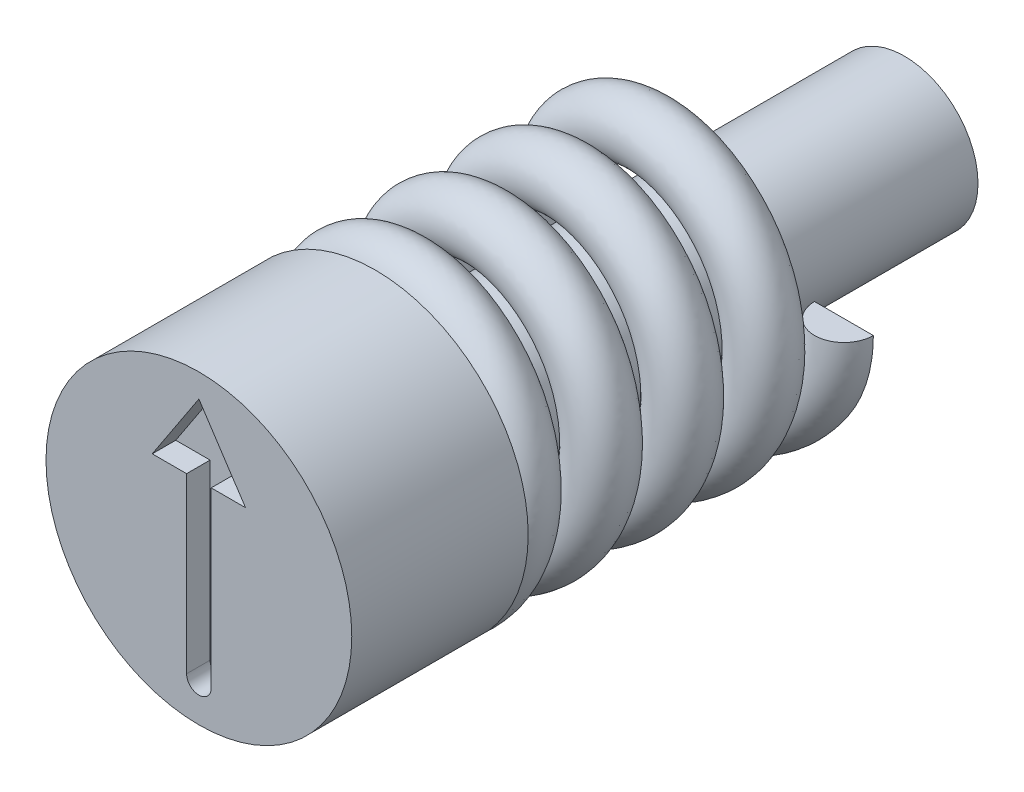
ISO-10303-21;
HEADER;
FILE_DESCRIPTION(('STEP AP214'),'2;1');
FILE_NAME('part.step','',(''),(''),'','','');
FILE_SCHEMA(('AUTOMOTIVE_DESIGN { 1 0 10303 214 1 1 1 1 }'));
ENDSEC;
DATA;
#1=APPLICATION_CONTEXT('core data for automotive mechanical design processes');
#2=APPLICATION_PROTOCOL_DEFINITION('international standard','automotive_design',2000,#1);
#3=PRODUCT_CONTEXT('',#1,'mechanical');
#4=PRODUCT('Part','Part','',(#3));
#5=PRODUCT_RELATED_PRODUCT_CATEGORY('part','',(#4));
#6=PRODUCT_DEFINITION_FORMATION('','',#4);
#7=PRODUCT_DEFINITION_CONTEXT('part definition',#1,'design');
#8=PRODUCT_DEFINITION('design','',#6,#7);
#9=PRODUCT_DEFINITION_SHAPE('','',#8);
#10=(LENGTH_UNIT() NAMED_UNIT(*) SI_UNIT(.MILLI.,.METRE.));
#11=(NAMED_UNIT(*) PLANE_ANGLE_UNIT() SI_UNIT($,.RADIAN.));
#12=(NAMED_UNIT(*) SI_UNIT($,.STERADIAN.) SOLID_ANGLE_UNIT());
#13=UNCERTAINTY_MEASURE_WITH_UNIT(LENGTH_MEASURE(1.E-05),#10,'distance_accuracy_value','');
#14=(GEOMETRIC_REPRESENTATION_CONTEXT(3) GLOBAL_UNCERTAINTY_ASSIGNED_CONTEXT((#13)) GLOBAL_UNIT_ASSIGNED_CONTEXT((#10,
#11,#12)) REPRESENTATION_CONTEXT('',''));
#15=CARTESIAN_POINT('',(0.,0.,0.));
#16=DIRECTION('',(0.,0.,1.));
#17=DIRECTION('',(1.,0.,0.));
#18=AXIS2_PLACEMENT_3D('',#15,#16,#17);
#19=CARTESIAN_POINT('',(2.1,0.,-9.37));
#20=DIRECTION('',(0.,-1.,0.));
#21=DIRECTION('',(0.,0.,-1.));
#22=AXIS2_PLACEMENT_3D('',#19,#20,#21);
#23=PLANE('',#22);
#24=CARTESIAN_POINT('',(2.1,0.,-8.87));
#25=DIRECTION('',(0.,1.,0.));
#26=DIRECTION('',(0.,0.,1.));
#27=AXIS2_PLACEMENT_3D('',#24,#25,#26);
#28=CIRCLE('',#27,0.5);
#29=CARTESIAN_POINT('',(1.6,0.,-8.87));
#30=VERTEX_POINT('',#29);
#31=CARTESIAN_POINT('',(2.6,0.,-8.87));
#32=VERTEX_POINT('',#31);
#33=EDGE_CURVE('E88',#30,#32,#28,.T.);
#34=ORIENTED_EDGE('',*,*,#33,.T.);
#35=DIRECTION('',(-1.,0.,0.));
#36=VECTOR('',#35,1.);
#37=CARTESIAN_POINT('',(2.1,0.,-8.87));
#38=LINE('',#37,#36);
#39=EDGE_CURVE('E75',#32,#30,#38,.T.);
#40=ORIENTED_EDGE('',*,*,#39,.T.);
#41=EDGE_LOOP('',(#34,#40));
#42=FACE_BOUND('',#41,.T.);
#43=ADVANCED_FACE('F49',(#42),#23,.F.);
#44=CARTESIAN_POINT('',(0.,-2.1,-3.5));
#45=DIRECTION('',(-1.,0.,0.));
#46=DIRECTION('',(0.,-1.,0.));
#47=AXIS2_PLACEMENT_3D('',#44,#45,#46);
#48=PLANE('',#47);
#49=DIRECTION('',(0.,-1.,0.));
#50=VECTOR('',#49,1.);
#51=CARTESIAN_POINT('',(0.,-2.1,-3.));
#52=LINE('',#51,#50);
#53=CARTESIAN_POINT('',(0.,-1.6,-3.));
#54=VERTEX_POINT('',#53);
#55=CARTESIAN_POINT('',(0.,-2.6,-3.));
#56=VERTEX_POINT('',#55);
#57=EDGE_CURVE('E69',#54,#56,#52,.T.);
#58=ORIENTED_EDGE('',*,*,#57,.F.);
#59=CARTESIAN_POINT('',(0.,-2.1,-3.));
#60=DIRECTION('',(-1.,0.,0.));
#61=DIRECTION('',(0.,-1.,0.));
#62=AXIS2_PLACEMENT_3D('',#59,#60,#61);
#63=CIRCLE('',#62,0.5);
#64=EDGE_CURVE('E85',#54,#56,#63,.T.);
#65=ORIENTED_EDGE('',*,*,#64,.T.);
#66=EDGE_LOOP('',(#58,#65));
#67=FACE_BOUND('',#66,.T.);
#68=ADVANCED_FACE('F51',(#67),#48,.T.);
#69=CARTESIAN_POINT('',(2.1,0.,-8.37));
#70=CARTESIAN_POINT('',(2.1,-0.8698484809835,-8.28367647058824));
#71=CARTESIAN_POINT('',(1.48492424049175,-1.48492424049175,-8.19735294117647));
#72=CARTESIAN_POINT('',(0.8698484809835,-2.1,-8.11102941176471));
#73=CARTESIAN_POINT('',(0.,-2.1,-8.02470588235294));
#74=CARTESIAN_POINT('',(-0.8698484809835,-2.1,-7.93838235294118));
#75=CARTESIAN_POINT('',(-1.48492424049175,-1.48492424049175,-7.85205882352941));
#76=CARTESIAN_POINT('',(-2.1,-0.8698484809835,-7.76573529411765));
#77=CARTESIAN_POINT('',(-2.1,0.,-7.67941176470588));
#78=CARTESIAN_POINT('',(-2.1,0.869848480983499,-7.59308823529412));
#79=CARTESIAN_POINT('',(-1.48492424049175,1.48492424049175,-7.50676470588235));
#80=CARTESIAN_POINT('',(-0.869848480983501,2.1,-7.42044117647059));
#81=CARTESIAN_POINT('',(0.,2.1,-7.33411764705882));
#82=CARTESIAN_POINT('',(0.8698484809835,2.1,-7.24779411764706));
#83=CARTESIAN_POINT('',(1.48492424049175,1.48492424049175,-7.1614705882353));
#84=CARTESIAN_POINT('',(2.1,0.869848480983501,-7.07514705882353));
#85=CARTESIAN_POINT('',(2.1,0.,-6.98882352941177));
#86=CARTESIAN_POINT('',(2.1,-0.8698484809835,-6.9025));
#87=CARTESIAN_POINT('',(1.48492424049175,-1.48492424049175,-6.81617647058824));
#88=CARTESIAN_POINT('',(0.8698484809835,-2.1,-6.72985294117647));
#89=CARTESIAN_POINT('',(0.,-2.1,-6.64352941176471));
#90=CARTESIAN_POINT('',(-0.8698484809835,-2.1,-6.55720588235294));
#91=CARTESIAN_POINT('',(-1.48492424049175,-1.48492424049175,-6.47088235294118));
#92=CARTESIAN_POINT('',(-2.1,-0.8698484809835,-6.38455882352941));
#93=CARTESIAN_POINT('',(-2.1,0.,-6.29823529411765));
#94=CARTESIAN_POINT('',(-2.1,0.869848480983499,-6.21191176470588));
#95=CARTESIAN_POINT('',(-1.48492424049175,1.48492424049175,-6.12558823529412));
#96=CARTESIAN_POINT('',(-0.869848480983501,2.1,-6.03926470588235));
#97=CARTESIAN_POINT('',(0.,2.1,-5.95294117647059));
#98=CARTESIAN_POINT('',(0.8698484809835,2.1,-5.86661764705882));
#99=CARTESIAN_POINT('',(1.48492424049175,1.48492424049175,-5.78029411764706));
#100=CARTESIAN_POINT('',(2.1,0.869848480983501,-5.6939705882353));
#101=CARTESIAN_POINT('',(2.1,0.,-5.60764705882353));
#102=CARTESIAN_POINT('',(2.1,-0.8698484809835,-5.52132352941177));
#103=CARTESIAN_POINT('',(1.48492424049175,-1.48492424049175,-5.435));
#104=CARTESIAN_POINT('',(0.8698484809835,-2.1,-5.34867647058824));
#105=CARTESIAN_POINT('',(0.,-2.1,-5.26235294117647));
#106=CARTESIAN_POINT('',(-0.8698484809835,-2.1,-5.17602941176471));
#107=CARTESIAN_POINT('',(-1.48492424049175,-1.48492424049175,-5.08970588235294));
#108=CARTESIAN_POINT('',(-2.1,-0.8698484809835,-5.00338235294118));
#109=CARTESIAN_POINT('',(-2.1,0.,-4.91705882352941));
#110=CARTESIAN_POINT('',(-2.1,0.869848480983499,-4.83073529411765));
#111=CARTESIAN_POINT('',(-1.48492424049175,1.48492424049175,-4.74441176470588));
#112=CARTESIAN_POINT('',(-0.869848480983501,2.1,-4.65808823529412));
#113=CARTESIAN_POINT('',(0.,2.1,-4.57176470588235));
#114=CARTESIAN_POINT('',(0.8698484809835,2.1,-4.48544117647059));
#115=CARTESIAN_POINT('',(1.48492424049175,1.48492424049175,-4.39911764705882));
#116=CARTESIAN_POINT('',(2.1,0.869848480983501,-4.31279411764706));
#117=CARTESIAN_POINT('',(2.1,0.,-4.2264705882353));
#118=CARTESIAN_POINT('',(2.1,-0.8698484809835,-4.14014705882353));
#119=CARTESIAN_POINT('',(1.48492424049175,-1.48492424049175,-4.05382352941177));
#120=CARTESIAN_POINT('',(0.8698484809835,-2.1,-3.9675));
#121=CARTESIAN_POINT('',(0.,-2.1,-3.88117647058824));
#122=CARTESIAN_POINT('',(-0.8698484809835,-2.1,-3.79485294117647));
#123=CARTESIAN_POINT('',(-1.48492424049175,-1.48492424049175,-3.70852941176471));
#124=CARTESIAN_POINT('',(-2.1,-0.8698484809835,-3.62220588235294));
#125=CARTESIAN_POINT('',(-2.1,0.,-3.53588235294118));
#126=CARTESIAN_POINT('',(-2.1,0.869848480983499,-3.44955882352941));
#127=CARTESIAN_POINT('',(-1.48492424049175,1.48492424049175,-3.36323529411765));
#128=CARTESIAN_POINT('',(-0.869848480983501,2.1,-3.27691176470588));
#129=CARTESIAN_POINT('',(0.,2.1,-3.19058823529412));
#130=CARTESIAN_POINT('',(0.8698484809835,2.1,-3.10426470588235));
#131=CARTESIAN_POINT('',(1.48492424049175,1.48492424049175,-3.01794117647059));
#132=CARTESIAN_POINT('',(2.1,0.869848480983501,-2.93161764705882));
#133=CARTESIAN_POINT('',(2.1,0.,-2.84529411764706));
#134=CARTESIAN_POINT('',(2.1,-0.8698484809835,-2.7589705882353));
#135=CARTESIAN_POINT('',(1.48492424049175,-1.48492424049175,-2.67264705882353));
#136=CARTESIAN_POINT('',(0.8698484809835,-2.1,-2.58632352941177));
#137=CARTESIAN_POINT('',(0.,-2.1,-2.5));
#138=CARTESIAN_POINT('',(3.1,0.,-8.37));
#139=CARTESIAN_POINT('',(3.1,-1.2840620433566,-8.28367647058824));
#140=CARTESIAN_POINT('',(2.1920310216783,-2.1920310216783,-8.19735294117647));
#141=CARTESIAN_POINT('',(1.2840620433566,-3.1,-8.11102941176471));
#142=CARTESIAN_POINT('',(0.,-3.1,-8.02470588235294));
#143=CARTESIAN_POINT('',(-1.28406204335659,-3.1,-7.93838235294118));
#144=CARTESIAN_POINT('',(-2.1920310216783,-2.1920310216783,-7.85205882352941));
#145=CARTESIAN_POINT('',(-3.1,-1.2840620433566,-7.76573529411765));
#146=CARTESIAN_POINT('',(-3.1,0.,-7.67941176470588));
#147=CARTESIAN_POINT('',(-3.1,1.28406204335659,-7.59308823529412));
#148=CARTESIAN_POINT('',(-2.1920310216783,2.1920310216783,-7.50676470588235));
#149=CARTESIAN_POINT('',(-1.2840620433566,3.1,-7.42044117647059));
#150=CARTESIAN_POINT('',(0.,3.1,-7.33411764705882));
#151=CARTESIAN_POINT('',(1.2840620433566,3.1,-7.24779411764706));
#152=CARTESIAN_POINT('',(2.1920310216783,2.1920310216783,-7.1614705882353));
#153=CARTESIAN_POINT('',(3.1,1.2840620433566,-7.07514705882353));
#154=CARTESIAN_POINT('',(3.1,0.,-6.98882352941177));
#155=CARTESIAN_POINT('',(3.1,-1.2840620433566,-6.9025));
#156=CARTESIAN_POINT('',(2.1920310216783,-2.1920310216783,-6.81617647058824));
#157=CARTESIAN_POINT('',(1.2840620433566,-3.1,-6.72985294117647));
#158=CARTESIAN_POINT('',(0.,-3.1,-6.64352941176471));
#159=CARTESIAN_POINT('',(-1.28406204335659,-3.1,-6.55720588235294));
#160=CARTESIAN_POINT('',(-2.1920310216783,-2.1920310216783,-6.47088235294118));
#161=CARTESIAN_POINT('',(-3.1,-1.2840620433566,-6.38455882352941));
#162=CARTESIAN_POINT('',(-3.1,0.,-6.29823529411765));
#163=CARTESIAN_POINT('',(-3.1,1.28406204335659,-6.21191176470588));
#164=CARTESIAN_POINT('',(-2.1920310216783,2.1920310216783,-6.12558823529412));
#165=CARTESIAN_POINT('',(-1.2840620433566,3.1,-6.03926470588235));
#166=CARTESIAN_POINT('',(0.,3.1,-5.95294117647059));
#167=CARTESIAN_POINT('',(1.2840620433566,3.1,-5.86661764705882));
#168=CARTESIAN_POINT('',(2.1920310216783,2.1920310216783,-5.78029411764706));
#169=CARTESIAN_POINT('',(3.1,1.2840620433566,-5.69397058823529));
#170=CARTESIAN_POINT('',(3.1,0.,-5.60764705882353));
#171=CARTESIAN_POINT('',(3.1,-1.2840620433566,-5.52132352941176));
#172=CARTESIAN_POINT('',(2.1920310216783,-2.1920310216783,-5.435));
#173=CARTESIAN_POINT('',(1.2840620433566,-3.1,-5.34867647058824));
#174=CARTESIAN_POINT('',(0.,-3.1,-5.26235294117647));
#175=CARTESIAN_POINT('',(-1.28406204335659,-3.1,-5.17602941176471));
#176=CARTESIAN_POINT('',(-2.1920310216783,-2.1920310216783,-5.08970588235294));
#177=CARTESIAN_POINT('',(-3.1,-1.2840620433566,-5.00338235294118));
#178=CARTESIAN_POINT('',(-3.1,0.,-4.91705882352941));
#179=CARTESIAN_POINT('',(-3.1,1.28406204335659,-4.83073529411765));
#180=CARTESIAN_POINT('',(-2.1920310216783,2.1920310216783,-4.74441176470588));
#181=CARTESIAN_POINT('',(-1.2840620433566,3.1,-4.65808823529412));
#182=CARTESIAN_POINT('',(0.,3.1,-4.57176470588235));
#183=CARTESIAN_POINT('',(1.2840620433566,3.1,-4.48544117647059));
#184=CARTESIAN_POINT('',(2.1920310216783,2.1920310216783,-4.39911764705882));
#185=CARTESIAN_POINT('',(3.1,1.2840620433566,-4.31279411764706));
#186=CARTESIAN_POINT('',(3.1,0.,-4.2264705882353));
#187=CARTESIAN_POINT('',(3.1,-1.2840620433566,-4.14014705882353));
#188=CARTESIAN_POINT('',(2.1920310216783,-2.1920310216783,-4.05382352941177));
#189=CARTESIAN_POINT('',(1.2840620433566,-3.1,-3.9675));
#190=CARTESIAN_POINT('',(0.,-3.1,-3.88117647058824));
#191=CARTESIAN_POINT('',(-1.28406204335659,-3.1,-3.79485294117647));
#192=CARTESIAN_POINT('',(-2.1920310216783,-2.1920310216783,-3.70852941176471));
#193=CARTESIAN_POINT('',(-3.1,-1.2840620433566,-3.62220588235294));
#194=CARTESIAN_POINT('',(-3.1,0.,-3.53588235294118));
#195=CARTESIAN_POINT('',(-3.1,1.28406204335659,-3.44955882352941));
#196=CARTESIAN_POINT('',(-2.1920310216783,2.1920310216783,-3.36323529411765));
#197=CARTESIAN_POINT('',(-1.2840620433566,3.1,-3.27691176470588));
#198=CARTESIAN_POINT('',(0.,3.1,-3.19058823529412));
#199=CARTESIAN_POINT('',(1.2840620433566,3.1,-3.10426470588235));
#200=CARTESIAN_POINT('',(2.1920310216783,2.1920310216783,-3.01794117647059));
#201=CARTESIAN_POINT('',(3.1,1.2840620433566,-2.93161764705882));
#202=CARTESIAN_POINT('',(3.1,0.,-2.84529411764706));
#203=CARTESIAN_POINT('',(3.1,-1.2840620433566,-2.75897058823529));
#204=CARTESIAN_POINT('',(2.1920310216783,-2.1920310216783,-2.67264705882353));
#205=CARTESIAN_POINT('',(1.2840620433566,-3.1,-2.58632352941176));
#206=CARTESIAN_POINT('',(0.,-3.1,-2.5));
#207=CARTESIAN_POINT('',(3.1,0.,-9.37));
#208=CARTESIAN_POINT('',(3.1,-1.2840620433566,-9.28367647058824));
#209=CARTESIAN_POINT('',(2.1920310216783,-2.1920310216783,-9.19735294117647));
#210=CARTESIAN_POINT('',(1.2840620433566,-3.1,-9.11102941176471));
#211=CARTESIAN_POINT('',(0.,-3.1,-9.02470588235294));
#212=CARTESIAN_POINT('',(-1.28406204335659,-3.1,-8.93838235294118));
#213=CARTESIAN_POINT('',(-2.1920310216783,-2.1920310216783,-8.85205882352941));
#214=CARTESIAN_POINT('',(-3.1,-1.2840620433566,-8.76573529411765));
#215=CARTESIAN_POINT('',(-3.1,0.,-8.67941176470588));
#216=CARTESIAN_POINT('',(-3.1,1.28406204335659,-8.59308823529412));
#217=CARTESIAN_POINT('',(-2.1920310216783,2.1920310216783,-8.50676470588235));
#218=CARTESIAN_POINT('',(-1.2840620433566,3.1,-8.42044117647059));
#219=CARTESIAN_POINT('',(0.,3.1,-8.33411764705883));
#220=CARTESIAN_POINT('',(1.2840620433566,3.1,-8.24779411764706));
#221=CARTESIAN_POINT('',(2.1920310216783,2.1920310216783,-8.16147058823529));
#222=CARTESIAN_POINT('',(3.1,1.2840620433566,-8.07514705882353));
#223=CARTESIAN_POINT('',(3.1,0.,-7.98882352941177));
#224=CARTESIAN_POINT('',(3.1,-1.2840620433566,-7.9025));
#225=CARTESIAN_POINT('',(2.1920310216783,-2.1920310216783,-7.81617647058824));
#226=CARTESIAN_POINT('',(1.2840620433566,-3.1,-7.72985294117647));
#227=CARTESIAN_POINT('',(0.,-3.1,-7.64352941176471));
#228=CARTESIAN_POINT('',(-1.28406204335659,-3.1,-7.55720588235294));
#229=CARTESIAN_POINT('',(-2.1920310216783,-2.1920310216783,-7.47088235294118));
#230=CARTESIAN_POINT('',(-3.1,-1.2840620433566,-7.38455882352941));
#231=CARTESIAN_POINT('',(-3.1,0.,-7.29823529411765));
#232=CARTESIAN_POINT('',(-3.1,1.28406204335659,-7.21191176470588));
#233=CARTESIAN_POINT('',(-2.1920310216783,2.1920310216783,-7.12558823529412));
#234=CARTESIAN_POINT('',(-1.2840620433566,3.1,-7.03926470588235));
#235=CARTESIAN_POINT('',(0.,3.1,-6.95294117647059));
#236=CARTESIAN_POINT('',(1.2840620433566,3.1,-6.86661764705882));
#237=CARTESIAN_POINT('',(2.1920310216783,2.1920310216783,-6.78029411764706));
#238=CARTESIAN_POINT('',(3.1,1.2840620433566,-6.6939705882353));
#239=CARTESIAN_POINT('',(3.1,0.,-6.60764705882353));
#240=CARTESIAN_POINT('',(3.1,-1.2840620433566,-6.52132352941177));
#241=CARTESIAN_POINT('',(2.1920310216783,-2.1920310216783,-6.435));
#242=CARTESIAN_POINT('',(1.2840620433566,-3.1,-6.34867647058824));
#243=CARTESIAN_POINT('',(0.,-3.1,-6.26235294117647));
#244=CARTESIAN_POINT('',(-1.28406204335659,-3.1,-6.17602941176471));
#245=CARTESIAN_POINT('',(-2.1920310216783,-2.1920310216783,-6.08970588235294));
#246=CARTESIAN_POINT('',(-3.1,-1.2840620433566,-6.00338235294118));
#247=CARTESIAN_POINT('',(-3.1,0.,-5.91705882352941));
#248=CARTESIAN_POINT('',(-3.1,1.28406204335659,-5.83073529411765));
#249=CARTESIAN_POINT('',(-2.1920310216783,2.1920310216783,-5.74441176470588));
#250=CARTESIAN_POINT('',(-1.2840620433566,3.1,-5.65808823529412));
#251=CARTESIAN_POINT('',(0.,3.1,-5.57176470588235));
#252=CARTESIAN_POINT('',(1.2840620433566,3.1,-5.48544117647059));
#253=CARTESIAN_POINT('',(2.1920310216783,2.1920310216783,-5.39911764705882));
#254=CARTESIAN_POINT('',(3.1,1.2840620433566,-5.31279411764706));
#255=CARTESIAN_POINT('',(3.1,0.,-5.2264705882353));
#256=CARTESIAN_POINT('',(3.1,-1.2840620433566,-5.14014705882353));
#257=CARTESIAN_POINT('',(2.1920310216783,-2.1920310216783,-5.05382352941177));
#258=CARTESIAN_POINT('',(1.2840620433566,-3.1,-4.9675));
#259=CARTESIAN_POINT('',(0.,-3.1,-4.88117647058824));
#260=CARTESIAN_POINT('',(-1.28406204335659,-3.1,-4.79485294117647));
#261=CARTESIAN_POINT('',(-2.1920310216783,-2.1920310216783,-4.70852941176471));
#262=CARTESIAN_POINT('',(-3.1,-1.2840620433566,-4.62220588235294));
#263=CARTESIAN_POINT('',(-3.1,0.,-4.53588235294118));
#264=CARTESIAN_POINT('',(-3.1,1.28406204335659,-4.44955882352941));
#265=CARTESIAN_POINT('',(-2.1920310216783,2.1920310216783,-4.36323529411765));
#266=CARTESIAN_POINT('',(-1.2840620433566,3.1,-4.27691176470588));
#267=CARTESIAN_POINT('',(0.,3.1,-4.19058823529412));
#268=CARTESIAN_POINT('',(1.2840620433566,3.1,-4.10426470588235));
#269=CARTESIAN_POINT('',(2.1920310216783,2.1920310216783,-4.01794117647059));
#270=CARTESIAN_POINT('',(3.1,1.2840620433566,-3.93161764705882));
#271=CARTESIAN_POINT('',(3.1,0.,-3.84529411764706));
#272=CARTESIAN_POINT('',(3.1,-1.2840620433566,-3.7589705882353));
#273=CARTESIAN_POINT('',(2.1920310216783,-2.1920310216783,-3.67264705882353));
#274=CARTESIAN_POINT('',(1.2840620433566,-3.1,-3.58632352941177));
#275=CARTESIAN_POINT('',(0.,-3.1,-3.5));
#276=CARTESIAN_POINT('',(2.1,0.,-9.37));
#277=CARTESIAN_POINT('',(2.1,-0.8698484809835,-9.28367647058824));
#278=CARTESIAN_POINT('',(1.48492424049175,-1.48492424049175,-9.19735294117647));
#279=CARTESIAN_POINT('',(0.8698484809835,-2.1,-9.11102941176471));
#280=CARTESIAN_POINT('',(0.,-2.1,-9.02470588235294));
#281=CARTESIAN_POINT('',(-0.8698484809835,-2.1,-8.93838235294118));
#282=CARTESIAN_POINT('',(-1.48492424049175,-1.48492424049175,-8.85205882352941));
#283=CARTESIAN_POINT('',(-2.1,-0.8698484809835,-8.76573529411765));
#284=CARTESIAN_POINT('',(-2.1,0.,-8.67941176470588));
#285=CARTESIAN_POINT('',(-2.1,0.869848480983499,-8.59308823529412));
#286=CARTESIAN_POINT('',(-1.48492424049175,1.48492424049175,-8.50676470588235));
#287=CARTESIAN_POINT('',(-0.869848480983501,2.1,-8.42044117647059));
#288=CARTESIAN_POINT('',(0.,2.1,-8.33411764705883));
#289=CARTESIAN_POINT('',(0.8698484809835,2.1,-8.24779411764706));
#290=CARTESIAN_POINT('',(1.48492424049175,1.48492424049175,-8.1614705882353));
#291=CARTESIAN_POINT('',(2.1,0.869848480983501,-8.07514705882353));
#292=CARTESIAN_POINT('',(2.1,0.,-7.98882352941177));
#293=CARTESIAN_POINT('',(2.1,-0.8698484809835,-7.9025));
#294=CARTESIAN_POINT('',(1.48492424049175,-1.48492424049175,-7.81617647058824));
#295=CARTESIAN_POINT('',(0.8698484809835,-2.1,-7.72985294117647));
#296=CARTESIAN_POINT('',(0.,-2.1,-7.64352941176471));
#297=CARTESIAN_POINT('',(-0.8698484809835,-2.1,-7.55720588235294));
#298=CARTESIAN_POINT('',(-1.48492424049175,-1.48492424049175,-7.47088235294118));
#299=CARTESIAN_POINT('',(-2.1,-0.8698484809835,-7.38455882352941));
#300=CARTESIAN_POINT('',(-2.1,0.,-7.29823529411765));
#301=CARTESIAN_POINT('',(-2.1,0.869848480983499,-7.21191176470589));
#302=CARTESIAN_POINT('',(-1.48492424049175,1.48492424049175,-7.12558823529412));
#303=CARTESIAN_POINT('',(-0.869848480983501,2.1,-7.03926470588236));
#304=CARTESIAN_POINT('',(0.,2.1,-6.95294117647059));
#305=CARTESIAN_POINT('',(0.8698484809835,2.1,-6.86661764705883));
#306=CARTESIAN_POINT('',(1.48492424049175,1.48492424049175,-6.78029411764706));
#307=CARTESIAN_POINT('',(2.1,0.869848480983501,-6.6939705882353));
#308=CARTESIAN_POINT('',(2.1,0.,-6.60764705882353));
#309=CARTESIAN_POINT('',(2.1,-0.8698484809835,-6.52132352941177));
#310=CARTESIAN_POINT('',(1.48492424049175,-1.48492424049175,-6.435));
#311=CARTESIAN_POINT('',(0.8698484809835,-2.1,-6.34867647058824));
#312=CARTESIAN_POINT('',(0.,-2.1,-6.26235294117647));
#313=CARTESIAN_POINT('',(-0.8698484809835,-2.1,-6.17602941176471));
#314=CARTESIAN_POINT('',(-1.48492424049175,-1.48492424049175,-6.08970588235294));
#315=CARTESIAN_POINT('',(-2.1,-0.8698484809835,-6.00338235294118));
#316=CARTESIAN_POINT('',(-2.1,0.,-5.91705882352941));
#317=CARTESIAN_POINT('',(-2.1,0.869848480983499,-5.83073529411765));
#318=CARTESIAN_POINT('',(-1.48492424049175,1.48492424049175,-5.74441176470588));
#319=CARTESIAN_POINT('',(-0.869848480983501,2.1,-5.65808823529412));
#320=CARTESIAN_POINT('',(0.,2.1,-5.57176470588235));
#321=CARTESIAN_POINT('',(0.8698484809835,2.1,-5.48544117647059));
#322=CARTESIAN_POINT('',(1.48492424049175,1.48492424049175,-5.39911764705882));
#323=CARTESIAN_POINT('',(2.1,0.869848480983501,-5.31279411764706));
#324=CARTESIAN_POINT('',(2.1,0.,-5.2264705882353));
#325=CARTESIAN_POINT('',(2.1,-0.8698484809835,-5.14014705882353));
#326=CARTESIAN_POINT('',(1.48492424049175,-1.48492424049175,-5.05382352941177));
#327=CARTESIAN_POINT('',(0.8698484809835,-2.1,-4.9675));
#328=CARTESIAN_POINT('',(0.,-2.1,-4.88117647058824));
#329=CARTESIAN_POINT('',(-0.8698484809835,-2.1,-4.79485294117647));
#330=CARTESIAN_POINT('',(-1.48492424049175,-1.48492424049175,-4.70852941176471));
#331=CARTESIAN_POINT('',(-2.1,-0.8698484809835,-4.62220588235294));
#332=CARTESIAN_POINT('',(-2.1,0.,-4.53588235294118));
#333=CARTESIAN_POINT('',(-2.1,0.869848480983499,-4.44955882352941));
#334=CARTESIAN_POINT('',(-1.48492424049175,1.48492424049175,-4.36323529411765));
#335=CARTESIAN_POINT('',(-0.869848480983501,2.1,-4.27691176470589));
#336=CARTESIAN_POINT('',(0.,2.1,-4.19058823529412));
#337=CARTESIAN_POINT('',(0.8698484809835,2.1,-4.10426470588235));
#338=CARTESIAN_POINT('',(1.48492424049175,1.48492424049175,-4.01794117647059));
#339=CARTESIAN_POINT('',(2.1,0.869848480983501,-3.93161764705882));
#340=CARTESIAN_POINT('',(2.1,0.,-3.84529411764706));
#341=CARTESIAN_POINT('',(2.1,-0.8698484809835,-3.7589705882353));
#342=CARTESIAN_POINT('',(1.48492424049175,-1.48492424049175,-3.67264705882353));
#343=CARTESIAN_POINT('',(0.8698484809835,-2.1,-3.58632352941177));
#344=CARTESIAN_POINT('',(0.,-2.1,-3.5));
#345=CARTESIAN_POINT('',(1.1,0.,-9.37));
#346=CARTESIAN_POINT('',(1.1,-0.455634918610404,-9.28367647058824));
#347=CARTESIAN_POINT('',(0.777817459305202,-0.777817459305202,-9.19735294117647));
#348=CARTESIAN_POINT('',(0.455634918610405,-1.1,-9.11102941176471));
#349=CARTESIAN_POINT('',(0.,-1.1,-9.02470588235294));
#350=CARTESIAN_POINT('',(-0.455634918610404,-1.1,-8.93838235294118));
#351=CARTESIAN_POINT('',(-0.777817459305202,-0.777817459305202,-8.85205882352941));
#352=CARTESIAN_POINT('',(-1.1,-0.455634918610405,-8.76573529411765));
#353=CARTESIAN_POINT('',(-1.1,0.,-8.67941176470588));
#354=CARTESIAN_POINT('',(-1.1,0.455634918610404,-8.59308823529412));
#355=CARTESIAN_POINT('',(-0.777817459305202,0.777817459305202,-8.50676470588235));
#356=CARTESIAN_POINT('',(-0.455634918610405,1.1,-8.42044117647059));
#357=CARTESIAN_POINT('',(0.,1.1,-8.33411764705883));
#358=CARTESIAN_POINT('',(0.455634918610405,1.1,-8.24779411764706));
#359=CARTESIAN_POINT('',(0.777817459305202,0.777817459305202,-8.16147058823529));
#360=CARTESIAN_POINT('',(1.1,0.455634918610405,-8.07514705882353));
#361=CARTESIAN_POINT('',(1.1,0.,-7.98882352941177));
#362=CARTESIAN_POINT('',(1.1,-0.455634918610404,-7.9025));
#363=CARTESIAN_POINT('',(0.777817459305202,-0.777817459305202,-7.81617647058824));
#364=CARTESIAN_POINT('',(0.455634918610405,-1.1,-7.72985294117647));
#365=CARTESIAN_POINT('',(0.,-1.1,-7.64352941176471));
#366=CARTESIAN_POINT('',(-0.455634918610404,-1.1,-7.55720588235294));
#367=CARTESIAN_POINT('',(-0.777817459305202,-0.777817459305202,-7.47088235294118));
#368=CARTESIAN_POINT('',(-1.1,-0.455634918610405,-7.38455882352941));
#369=CARTESIAN_POINT('',(-1.1,0.,-7.29823529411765));
#370=CARTESIAN_POINT('',(-1.1,0.455634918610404,-7.21191176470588));
#371=CARTESIAN_POINT('',(-0.777817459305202,0.777817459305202,-7.12558823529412));
#372=CARTESIAN_POINT('',(-0.455634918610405,1.1,-7.03926470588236));
#373=CARTESIAN_POINT('',(0.,1.1,-6.95294117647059));
#374=CARTESIAN_POINT('',(0.455634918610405,1.1,-6.86661764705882));
#375=CARTESIAN_POINT('',(0.777817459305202,0.777817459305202,-6.78029411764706));
#376=CARTESIAN_POINT('',(1.1,0.455634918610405,-6.6939705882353));
#377=CARTESIAN_POINT('',(1.1,0.,-6.60764705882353));
#378=CARTESIAN_POINT('',(1.1,-0.455634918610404,-6.52132352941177));
#379=CARTESIAN_POINT('',(0.777817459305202,-0.777817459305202,-6.435));
#380=CARTESIAN_POINT('',(0.455634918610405,-1.1,-6.34867647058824));
#381=CARTESIAN_POINT('',(0.,-1.1,-6.26235294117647));
#382=CARTESIAN_POINT('',(-0.455634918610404,-1.1,-6.17602941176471));
#383=CARTESIAN_POINT('',(-0.777817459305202,-0.777817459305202,-6.08970588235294));
#384=CARTESIAN_POINT('',(-1.1,-0.455634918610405,-6.00338235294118));
#385=CARTESIAN_POINT('',(-1.1,0.,-5.91705882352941));
#386=CARTESIAN_POINT('',(-1.1,0.455634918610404,-5.83073529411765));
#387=CARTESIAN_POINT('',(-0.777817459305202,0.777817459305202,-5.74441176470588));
#388=CARTESIAN_POINT('',(-0.455634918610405,1.1,-5.65808823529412));
#389=CARTESIAN_POINT('',(0.,1.1,-5.57176470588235));
#390=CARTESIAN_POINT('',(0.455634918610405,1.1,-5.48544117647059));
#391=CARTESIAN_POINT('',(0.777817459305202,0.777817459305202,-5.39911764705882));
#392=CARTESIAN_POINT('',(1.1,0.455634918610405,-5.31279411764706));
#393=CARTESIAN_POINT('',(1.1,0.,-5.2264705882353));
#394=CARTESIAN_POINT('',(1.1,-0.455634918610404,-5.14014705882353));
#395=CARTESIAN_POINT('',(0.777817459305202,-0.777817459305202,-5.05382352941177));
#396=CARTESIAN_POINT('',(0.455634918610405,-1.1,-4.9675));
#397=CARTESIAN_POINT('',(0.,-1.1,-4.88117647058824));
#398=CARTESIAN_POINT('',(-0.455634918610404,-1.1,-4.79485294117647));
#399=CARTESIAN_POINT('',(-0.777817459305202,-0.777817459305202,-4.70852941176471));
#400=CARTESIAN_POINT('',(-1.1,-0.455634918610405,-4.62220588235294));
#401=CARTESIAN_POINT('',(-1.1,0.,-4.53588235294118));
#402=CARTESIAN_POINT('',(-1.1,0.455634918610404,-4.44955882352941));
#403=CARTESIAN_POINT('',(-0.777817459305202,0.777817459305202,-4.36323529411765));
#404=CARTESIAN_POINT('',(-0.455634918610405,1.1,-4.27691176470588));
#405=CARTESIAN_POINT('',(0.,1.1,-4.19058823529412));
#406=CARTESIAN_POINT('',(0.455634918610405,1.1,-4.10426470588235));
#407=CARTESIAN_POINT('',(0.777817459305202,0.777817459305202,-4.01794117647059));
#408=CARTESIAN_POINT('',(1.1,0.455634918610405,-3.93161764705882));
#409=CARTESIAN_POINT('',(1.1,0.,-3.84529411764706));
#410=CARTESIAN_POINT('',(1.1,-0.455634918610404,-3.7589705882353));
#411=CARTESIAN_POINT('',(0.777817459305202,-0.777817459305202,-3.67264705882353));
#412=CARTESIAN_POINT('',(0.455634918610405,-1.1,-3.58632352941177));
#413=CARTESIAN_POINT('',(0.,-1.1,-3.5));
#414=CARTESIAN_POINT('',(1.1,0.,-8.37));
#415=CARTESIAN_POINT('',(1.1,-0.455634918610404,-8.28367647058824));
#416=CARTESIAN_POINT('',(0.777817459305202,-0.777817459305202,-8.19735294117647));
#417=CARTESIAN_POINT('',(0.455634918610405,-1.1,-8.11102941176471));
#418=CARTESIAN_POINT('',(0.,-1.1,-8.02470588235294));
#419=CARTESIAN_POINT('',(-0.455634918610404,-1.1,-7.93838235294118));
#420=CARTESIAN_POINT('',(-0.777817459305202,-0.777817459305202,-7.85205882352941));
#421=CARTESIAN_POINT('',(-1.1,-0.455634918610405,-7.76573529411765));
#422=CARTESIAN_POINT('',(-1.1,0.,-7.67941176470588));
#423=CARTESIAN_POINT('',(-1.1,0.455634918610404,-7.59308823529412));
#424=CARTESIAN_POINT('',(-0.777817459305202,0.777817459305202,-7.50676470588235));
#425=CARTESIAN_POINT('',(-0.455634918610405,1.1,-7.42044117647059));
#426=CARTESIAN_POINT('',(0.,1.1,-7.33411764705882));
#427=CARTESIAN_POINT('',(0.455634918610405,1.1,-7.24779411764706));
#428=CARTESIAN_POINT('',(0.777817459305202,0.777817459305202,-7.1614705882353));
#429=CARTESIAN_POINT('',(1.1,0.455634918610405,-7.07514705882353));
#430=CARTESIAN_POINT('',(1.1,0.,-6.98882352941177));
#431=CARTESIAN_POINT('',(1.1,-0.455634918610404,-6.9025));
#432=CARTESIAN_POINT('',(0.777817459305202,-0.777817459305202,-6.81617647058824));
#433=CARTESIAN_POINT('',(0.455634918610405,-1.1,-6.72985294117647));
#434=CARTESIAN_POINT('',(0.,-1.1,-6.64352941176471));
#435=CARTESIAN_POINT('',(-0.455634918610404,-1.1,-6.55720588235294));
#436=CARTESIAN_POINT('',(-0.777817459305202,-0.777817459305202,-6.47088235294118));
#437=CARTESIAN_POINT('',(-1.1,-0.455634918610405,-6.38455882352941));
#438=CARTESIAN_POINT('',(-1.1,0.,-6.29823529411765));
#439=CARTESIAN_POINT('',(-1.1,0.455634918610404,-6.21191176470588));
#440=CARTESIAN_POINT('',(-0.777817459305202,0.777817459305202,-6.12558823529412));
#441=CARTESIAN_POINT('',(-0.455634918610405,1.1,-6.03926470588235));
#442=CARTESIAN_POINT('',(0.,1.1,-5.95294117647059));
#443=CARTESIAN_POINT('',(0.455634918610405,1.1,-5.86661764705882));
#444=CARTESIAN_POINT('',(0.777817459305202,0.777817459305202,-5.78029411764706));
#445=CARTESIAN_POINT('',(1.1,0.455634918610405,-5.69397058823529));
#446=CARTESIAN_POINT('',(1.1,0.,-5.60764705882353));
#447=CARTESIAN_POINT('',(1.1,-0.455634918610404,-5.52132352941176));
#448=CARTESIAN_POINT('',(0.777817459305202,-0.777817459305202,-5.435));
#449=CARTESIAN_POINT('',(0.455634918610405,-1.1,-5.34867647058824));
#450=CARTESIAN_POINT('',(0.,-1.1,-5.26235294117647));
#451=CARTESIAN_POINT('',(-0.455634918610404,-1.1,-5.17602941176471));
#452=CARTESIAN_POINT('',(-0.777817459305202,-0.777817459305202,-5.08970588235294));
#453=CARTESIAN_POINT('',(-1.1,-0.455634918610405,-5.00338235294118));
#454=CARTESIAN_POINT('',(-1.1,0.,-4.91705882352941));
#455=CARTESIAN_POINT('',(-1.1,0.455634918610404,-4.83073529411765));
#456=CARTESIAN_POINT('',(-0.777817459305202,0.777817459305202,-4.74441176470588));
#457=CARTESIAN_POINT('',(-0.455634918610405,1.1,-4.65808823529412));
#458=CARTESIAN_POINT('',(0.,1.1,-4.57176470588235));
#459=CARTESIAN_POINT('',(0.455634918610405,1.1,-4.48544117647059));
#460=CARTESIAN_POINT('',(0.777817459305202,0.777817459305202,-4.39911764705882));
#461=CARTESIAN_POINT('',(1.1,0.455634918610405,-4.31279411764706));
#462=CARTESIAN_POINT('',(1.1,0.,-4.2264705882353));
#463=CARTESIAN_POINT('',(1.1,-0.455634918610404,-4.14014705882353));
#464=CARTESIAN_POINT('',(0.777817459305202,-0.777817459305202,-4.05382352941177));
#465=CARTESIAN_POINT('',(0.455634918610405,-1.1,-3.9675));
#466=CARTESIAN_POINT('',(0.,-1.1,-3.88117647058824));
#467=CARTESIAN_POINT('',(-0.455634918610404,-1.1,-3.79485294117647));
#468=CARTESIAN_POINT('',(-0.777817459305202,-0.777817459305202,-3.70852941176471));
#469=CARTESIAN_POINT('',(-1.1,-0.455634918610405,-3.62220588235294));
#470=CARTESIAN_POINT('',(-1.1,0.,-3.53588235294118));
#471=CARTESIAN_POINT('',(-1.1,0.455634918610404,-3.44955882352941));
#472=CARTESIAN_POINT('',(-0.777817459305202,0.777817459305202,-3.36323529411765));
#473=CARTESIAN_POINT('',(-0.455634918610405,1.1,-3.27691176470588));
#474=CARTESIAN_POINT('',(0.,1.1,-3.19058823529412));
#475=CARTESIAN_POINT('',(0.455634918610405,1.1,-3.10426470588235));
#476=CARTESIAN_POINT('',(0.777817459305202,0.777817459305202,-3.01794117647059));
#477=CARTESIAN_POINT('',(1.1,0.455634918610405,-2.93161764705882));
#478=CARTESIAN_POINT('',(1.1,0.,-2.84529411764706));
#479=CARTESIAN_POINT('',(1.1,-0.455634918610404,-2.75897058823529));
#480=CARTESIAN_POINT('',(0.777817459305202,-0.777817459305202,-2.67264705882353));
#481=CARTESIAN_POINT('',(0.455634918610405,-1.1,-2.58632352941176));
#482=CARTESIAN_POINT('',(0.,-1.1,-2.5));
#483=CARTESIAN_POINT('',(2.1,0.,-8.37));
#484=CARTESIAN_POINT('',(2.1,-0.8698484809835,-8.28367647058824));
#485=CARTESIAN_POINT('',(1.48492424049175,-1.48492424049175,-8.19735294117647));
#486=CARTESIAN_POINT('',(0.8698484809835,-2.1,-8.11102941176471));
#487=CARTESIAN_POINT('',(0.,-2.1,-8.02470588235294));
#488=CARTESIAN_POINT('',(-0.8698484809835,-2.1,-7.93838235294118));
#489=CARTESIAN_POINT('',(-1.48492424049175,-1.48492424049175,-7.85205882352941));
#490=CARTESIAN_POINT('',(-2.1,-0.8698484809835,-7.76573529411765));
#491=CARTESIAN_POINT('',(-2.1,0.,-7.67941176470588));
#492=CARTESIAN_POINT('',(-2.1,0.869848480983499,-7.59308823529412));
#493=CARTESIAN_POINT('',(-1.48492424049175,1.48492424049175,-7.50676470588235));
#494=CARTESIAN_POINT('',(-0.869848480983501,2.1,-7.42044117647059));
#495=CARTESIAN_POINT('',(0.,2.1,-7.33411764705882));
#496=CARTESIAN_POINT('',(0.8698484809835,2.1,-7.24779411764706));
#497=CARTESIAN_POINT('',(1.48492424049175,1.48492424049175,-7.1614705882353));
#498=CARTESIAN_POINT('',(2.1,0.869848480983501,-7.07514705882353));
#499=CARTESIAN_POINT('',(2.1,0.,-6.98882352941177));
#500=CARTESIAN_POINT('',(2.1,-0.8698484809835,-6.9025));
#501=CARTESIAN_POINT('',(1.48492424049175,-1.48492424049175,-6.81617647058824));
#502=CARTESIAN_POINT('',(0.8698484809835,-2.1,-6.72985294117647));
#503=CARTESIAN_POINT('',(0.,-2.1,-6.64352941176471));
#504=CARTESIAN_POINT('',(-0.8698484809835,-2.1,-6.55720588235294));
#505=CARTESIAN_POINT('',(-1.48492424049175,-1.48492424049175,-6.47088235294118));
#506=CARTESIAN_POINT('',(-2.1,-0.8698484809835,-6.38455882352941));
#507=CARTESIAN_POINT('',(-2.1,0.,-6.29823529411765));
#508=CARTESIAN_POINT('',(-2.1,0.869848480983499,-6.21191176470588));
#509=CARTESIAN_POINT('',(-1.48492424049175,1.48492424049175,-6.12558823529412));
#510=CARTESIAN_POINT('',(-0.869848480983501,2.1,-6.03926470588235));
#511=CARTESIAN_POINT('',(0.,2.1,-5.95294117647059));
#512=CARTESIAN_POINT('',(0.8698484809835,2.1,-5.86661764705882));
#513=CARTESIAN_POINT('',(1.48492424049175,1.48492424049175,-5.78029411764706));
#514=CARTESIAN_POINT('',(2.1,0.869848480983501,-5.6939705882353));
#515=CARTESIAN_POINT('',(2.1,0.,-5.60764705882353));
#516=CARTESIAN_POINT('',(2.1,-0.8698484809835,-5.52132352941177));
#517=CARTESIAN_POINT('',(1.48492424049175,-1.48492424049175,-5.435));
#518=CARTESIAN_POINT('',(0.8698484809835,-2.1,-5.34867647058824));
#519=CARTESIAN_POINT('',(0.,-2.1,-5.26235294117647));
#520=CARTESIAN_POINT('',(-0.8698484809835,-2.1,-5.17602941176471));
#521=CARTESIAN_POINT('',(-1.48492424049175,-1.48492424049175,-5.08970588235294));
#522=CARTESIAN_POINT('',(-2.1,-0.8698484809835,-5.00338235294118));
#523=CARTESIAN_POINT('',(-2.1,0.,-4.91705882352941));
#524=CARTESIAN_POINT('',(-2.1,0.869848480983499,-4.83073529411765));
#525=CARTESIAN_POINT('',(-1.48492424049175,1.48492424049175,-4.74441176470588));
#526=CARTESIAN_POINT('',(-0.869848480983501,2.1,-4.65808823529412));
#527=CARTESIAN_POINT('',(0.,2.1,-4.57176470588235));
#528=CARTESIAN_POINT('',(0.8698484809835,2.1,-4.48544117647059));
#529=CARTESIAN_POINT('',(1.48492424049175,1.48492424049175,-4.39911764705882));
#530=CARTESIAN_POINT('',(2.1,0.869848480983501,-4.31279411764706));
#531=CARTESIAN_POINT('',(2.1,0.,-4.2264705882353));
#532=CARTESIAN_POINT('',(2.1,-0.8698484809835,-4.14014705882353));
#533=CARTESIAN_POINT('',(1.48492424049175,-1.48492424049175,-4.05382352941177));
#534=CARTESIAN_POINT('',(0.8698484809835,-2.1,-3.9675));
#535=CARTESIAN_POINT('',(0.,-2.1,-3.88117647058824));
#536=CARTESIAN_POINT('',(-0.8698484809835,-2.1,-3.79485294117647));
#537=CARTESIAN_POINT('',(-1.48492424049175,-1.48492424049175,-3.70852941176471));
#538=CARTESIAN_POINT('',(-2.1,-0.8698484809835,-3.62220588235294));
#539=CARTESIAN_POINT('',(-2.1,0.,-3.53588235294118));
#540=CARTESIAN_POINT('',(-2.1,0.869848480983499,-3.44955882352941));
#541=CARTESIAN_POINT('',(-1.48492424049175,1.48492424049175,-3.36323529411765));
#542=CARTESIAN_POINT('',(-0.869848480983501,2.1,-3.27691176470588));
#543=CARTESIAN_POINT('',(0.,2.1,-3.19058823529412));
#544=CARTESIAN_POINT('',(0.8698484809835,2.1,-3.10426470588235));
#545=CARTESIAN_POINT('',(1.48492424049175,1.48492424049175,-3.01794117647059));
#546=CARTESIAN_POINT('',(2.1,0.869848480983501,-2.93161764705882));
#547=CARTESIAN_POINT('',(2.1,0.,-2.84529411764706));
#548=CARTESIAN_POINT('',(2.1,-0.8698484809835,-2.7589705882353));
#549=CARTESIAN_POINT('',(1.48492424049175,-1.48492424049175,-2.67264705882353));
#550=CARTESIAN_POINT('',(0.8698484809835,-2.1,-2.58632352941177));
#551=CARTESIAN_POINT('',(0.,-2.1,-2.5));
#552=(BOUNDED_SURFACE() B_SPLINE_SURFACE(3,2,((#69,#70,#71,#72,#73,#74,#75,#76,#77,#78,#79,#80,
#81,#82,#83,#84,#85,#86,#87,#88,#89,#90,#91,#92,#93,#94,#95,#96,#97,#98,#99,#100,#101,#102,#103,
#104,#105,#106,#107,#108,#109,#110,#111,#112,#113,#114,#115,#116,#117,#118,#119,#120,#121,#122,
#123,#124,#125,#126,#127,#128,#129,#130,#131,#132,#133,#134,#135,#136,#137),(#138,#139,#140,
#141,#142,#143,#144,#145,#146,#147,#148,#149,#150,#151,#152,#153,#154,#155,#156,#157,#158,#159,
#160,#161,#162,#163,#164,#165,#166,#167,#168,#169,#170,#171,#172,#173,#174,#175,#176,#177,#178,
#179,#180,#181,#182,#183,#184,#185,#186,#187,#188,#189,#190,#191,#192,#193,#194,#195,#196,#197,
#198,#199,#200,#201,#202,#203,#204,#205,#206),(#207,#208,#209,#210,#211,#212,#213,#214,#215,
#216,#217,#218,#219,#220,#221,#222,#223,#224,#225,#226,#227,#228,#229,#230,#231,#232,#233,#234,
#235,#236,#237,#238,#239,#240,#241,#242,#243,#244,#245,#246,#247,#248,#249,#250,#251,#252,#253,
#254,#255,#256,#257,#258,#259,#260,#261,#262,#263,#264,#265,#266,#267,#268,#269,#270,#271,#272,
#273,#274,#275),(#276,#277,#278,#279,#280,#281,#282,#283,#284,#285,#286,#287,#288,#289,#290,
#291,#292,#293,#294,#295,#296,#297,#298,#299,#300,#301,#302,#303,#304,#305,#306,#307,#308,#309,
#310,#311,#312,#313,#314,#315,#316,#317,#318,#319,#320,#321,#322,#323,#324,#325,#326,#327,#328,
#329,#330,#331,#332,#333,#334,#335,#336,#337,#338,#339,#340,#341,#342,#343,#344),(#345,#346,
#347,#348,#349,#350,#351,#352,#353,#354,#355,#356,#357,#358,#359,#360,#361,#362,#363,#364,#365,
#366,#367,#368,#369,#370,#371,#372,#373,#374,#375,#376,#377,#378,#379,#380,#381,#382,#383,#384,
#385,#386,#387,#388,#389,#390,#391,#392,#393,#394,#395,#396,#397,#398,#399,#400,#401,#402,#403,
#404,#405,#406,#407,#408,#409,#410,#411,#412,#413),(#414,#415,#416,#417,#418,#419,#420,#421,
#422,#423,#424,#425,#426,#427,#428,#429,#430,#431,#432,#433,#434,#435,#436,#437,#438,#439,#440,
#441,#442,#443,#444,#445,#446,#447,#448,#449,#450,#451,#452,#453,#454,#455,#456,#457,#458,#459,
#460,#461,#462,#463,#464,#465,#466,#467,#468,#469,#470,#471,#472,#473,#474,#475,#476,#477,#478,
#479,#480,#481,#482),(#483,#484,#485,#486,#487,#488,#489,#490,#491,#492,#493,#494,#495,#496,
#497,#498,#499,#500,#501,#502,#503,#504,#505,#506,#507,#508,#509,#510,#511,#512,#513,#514,#515,
#516,#517,#518,#519,#520,#521,#522,#523,#524,#525,#526,#527,#528,#529,#530,#531,#532,#533,#534,
#535,#536,#537,#538,#539,#540,#541,#542,#543,#544,#545,#546,#547,#548,#549,#550,#551)),
.UNSPECIFIED.,.T.,.F.,.F.) B_SPLINE_SURFACE_WITH_KNOTS((4,3,4),(3,2,2,2,2,2,2,2,2,2,2,2,2,2,2,2,
2,2,2,2,2,2,2,2,2,2,2,2,2,2,2,2,2,2,3),(0.,0.5,1.),(0.,0.025,0.05,0.075,0.1,0.125,0.15,0.175,
0.2,0.225,0.25,0.275,0.3,0.325,0.35,0.375,0.4,0.425,0.45,0.475,0.5,0.525,0.55,0.575,0.6,0.625,
0.65,0.675,0.7,0.725,0.75,0.775,0.8,0.825,0.85),
.UNSPECIFIED.) GEOMETRIC_REPRESENTATION_ITEM() RATIONAL_B_SPLINE_SURFACE(((1.,0.923879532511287,
1.,0.923879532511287,1.,0.923879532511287,1.,0.923879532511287,1.,0.923879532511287,1.,
0.923879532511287,1.,0.923879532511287,1.,0.923879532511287,1.,0.923879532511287,1.,
0.923879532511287,1.,0.923879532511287,1.,0.923879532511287,1.,0.923879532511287,1.,
0.923879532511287,1.,0.923879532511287,1.,0.923879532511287,1.,0.923879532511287,1.,
0.923879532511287,1.,0.923879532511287,1.,0.923879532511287,1.,0.923879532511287,1.,
0.923879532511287,1.,0.923879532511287,1.,0.923879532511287,1.,0.923879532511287,1.,
0.923879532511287,1.,0.923879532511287,1.,0.923879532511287,1.,0.923879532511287,1.,
0.923879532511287,1.,0.923879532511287,1.,0.923879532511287,1.,0.923879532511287,1.,
0.923879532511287,1.),(0.333333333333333,0.307959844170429,0.333333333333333,0.307959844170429,
0.333333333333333,0.307959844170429,0.333333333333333,0.307959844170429,0.333333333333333,
0.307959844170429,0.333333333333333,0.307959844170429,0.333333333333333,0.307959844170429,
0.333333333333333,0.307959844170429,0.333333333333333,0.307959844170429,0.333333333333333,
0.307959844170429,0.333333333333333,0.307959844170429,0.333333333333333,0.307959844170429,
0.333333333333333,0.307959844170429,0.333333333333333,0.307959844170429,0.333333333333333,
0.307959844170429,0.333333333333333,0.307959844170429,0.333333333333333,0.307959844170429,
0.333333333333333,0.307959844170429,0.333333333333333,0.307959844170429,0.333333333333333,
0.307959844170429,0.333333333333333,0.307959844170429,0.333333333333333,0.307959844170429,
0.333333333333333,0.307959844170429,0.333333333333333,0.307959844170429,0.333333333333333,
0.307959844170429,0.333333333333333,0.307959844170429,0.333333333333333,0.307959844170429,
0.333333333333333,0.307959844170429,0.333333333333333,0.307959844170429,0.333333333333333,
0.307959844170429,0.333333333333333,0.307959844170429,0.333333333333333,0.307959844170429,
0.333333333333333,0.307959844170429,0.333333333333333,0.307959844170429,0.333333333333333),
(0.333333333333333,0.307959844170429,0.333333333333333,0.307959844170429,0.333333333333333,
0.307959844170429,0.333333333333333,0.307959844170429,0.333333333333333,0.307959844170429,
0.333333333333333,0.307959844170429,0.333333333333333,0.307959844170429,0.333333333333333,
0.307959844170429,0.333333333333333,0.307959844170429,0.333333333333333,0.307959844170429,
0.333333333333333,0.307959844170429,0.333333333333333,0.307959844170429,0.333333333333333,
0.307959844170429,0.333333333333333,0.307959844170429,0.333333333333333,0.307959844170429,
0.333333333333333,0.307959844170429,0.333333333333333,0.307959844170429,0.333333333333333,
0.307959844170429,0.333333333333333,0.307959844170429,0.333333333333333,0.307959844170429,
0.333333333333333,0.307959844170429,0.333333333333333,0.307959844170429,0.333333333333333,
0.307959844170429,0.333333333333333,0.307959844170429,0.333333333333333,0.307959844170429,
0.333333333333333,0.307959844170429,0.333333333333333,0.307959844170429,0.333333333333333,
0.307959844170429,0.333333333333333,0.307959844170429,0.333333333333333,0.307959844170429,
0.333333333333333,0.307959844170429,0.333333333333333,0.307959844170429,0.333333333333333,
0.307959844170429,0.333333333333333,0.307959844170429,0.333333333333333),(1.,0.923879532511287,
1.,0.923879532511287,1.,0.923879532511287,1.,0.923879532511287,1.,0.923879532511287,1.,
0.923879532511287,1.,0.923879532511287,1.,0.923879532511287,1.,0.923879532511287,1.,
0.923879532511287,1.,0.923879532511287,1.,0.923879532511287,1.,0.923879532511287,1.,
0.923879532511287,1.,0.923879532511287,1.,0.923879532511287,1.,0.923879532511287,1.,
0.923879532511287,1.,0.923879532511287,1.,0.923879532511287,1.,0.923879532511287,1.,
0.923879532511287,1.,0.923879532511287,1.,0.923879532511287,1.,0.923879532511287,1.,
0.923879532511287,1.,0.923879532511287,1.,0.923879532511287,1.,0.923879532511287,1.,
0.923879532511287,1.,0.923879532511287,1.,0.923879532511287,1.,0.923879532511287,1.,
0.923879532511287,1.),(0.333333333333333,0.307959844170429,0.333333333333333,0.307959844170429,
0.333333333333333,0.307959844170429,0.333333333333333,0.307959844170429,0.333333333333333,
0.307959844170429,0.333333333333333,0.307959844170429,0.333333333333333,0.307959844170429,
0.333333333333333,0.307959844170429,0.333333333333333,0.307959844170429,0.333333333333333,
0.307959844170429,0.333333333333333,0.307959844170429,0.333333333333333,0.307959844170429,
0.333333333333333,0.307959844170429,0.333333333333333,0.307959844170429,0.333333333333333,
0.307959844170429,0.333333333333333,0.307959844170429,0.333333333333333,0.307959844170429,
0.333333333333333,0.307959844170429,0.333333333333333,0.307959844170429,0.333333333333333,
0.307959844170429,0.333333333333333,0.307959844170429,0.333333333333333,0.307959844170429,
0.333333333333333,0.307959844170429,0.333333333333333,0.307959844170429,0.333333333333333,
0.307959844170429,0.333333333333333,0.307959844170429,0.333333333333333,0.307959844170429,
0.333333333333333,0.307959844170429,0.333333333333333,0.307959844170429,0.333333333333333,
0.307959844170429,0.333333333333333,0.307959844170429,0.333333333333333,0.307959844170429,
0.333333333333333,0.307959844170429,0.333333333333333,0.307959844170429,0.333333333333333),
(0.333333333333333,0.307959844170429,0.333333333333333,0.307959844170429,0.333333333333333,
0.307959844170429,0.333333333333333,0.307959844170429,0.333333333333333,0.307959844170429,
0.333333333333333,0.307959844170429,0.333333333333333,0.307959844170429,0.333333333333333,
0.307959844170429,0.333333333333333,0.307959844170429,0.333333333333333,0.307959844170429,
0.333333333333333,0.307959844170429,0.333333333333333,0.307959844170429,0.333333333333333,
0.307959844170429,0.333333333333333,0.307959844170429,0.333333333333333,0.307959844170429,
0.333333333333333,0.307959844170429,0.333333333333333,0.307959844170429,0.333333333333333,
0.307959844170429,0.333333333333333,0.307959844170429,0.333333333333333,0.307959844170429,
0.333333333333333,0.307959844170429,0.333333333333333,0.307959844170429,0.333333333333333,
0.307959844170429,0.333333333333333,0.307959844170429,0.333333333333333,0.307959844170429,
0.333333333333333,0.307959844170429,0.333333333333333,0.307959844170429,0.333333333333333,
0.307959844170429,0.333333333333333,0.307959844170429,0.333333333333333,0.307959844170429,
0.333333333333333,0.307959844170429,0.333333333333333,0.307959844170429,0.333333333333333,
0.307959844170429,0.333333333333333,0.307959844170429,0.333333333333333),(1.,0.923879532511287,
1.,0.923879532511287,1.,0.923879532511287,1.,0.923879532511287,1.,0.923879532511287,1.,
0.923879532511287,1.,0.923879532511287,1.,0.923879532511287,1.,0.923879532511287,1.,
0.923879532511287,1.,0.923879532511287,1.,0.923879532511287,1.,0.923879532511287,1.,
0.923879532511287,1.,0.923879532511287,1.,0.923879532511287,1.,0.923879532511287,1.,
0.923879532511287,1.,0.923879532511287,1.,0.923879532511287,1.,0.923879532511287,1.,
0.923879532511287,1.,0.923879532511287,1.,0.923879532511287,1.,0.923879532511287,1.,
0.923879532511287,1.,0.923879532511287,1.,0.923879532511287,1.,0.923879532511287,1.,
0.923879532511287,1.,0.923879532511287,1.,0.923879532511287,1.,0.923879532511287,1.,
0.923879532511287,1.))) REPRESENTATION_ITEM('') SURFACE());
#553=CARTESIAN_POINT('',(1.6,0.,-8.87));
#554=CARTESIAN_POINT('',(1.60003447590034,-0.0834590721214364,-8.87));
#555=CARTESIAN_POINT('',(1.59382669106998,-0.166879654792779,-8.87));
#556=CARTESIAN_POINT('',(1.56932636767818,-0.331985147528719,-8.87));
#557=CARTESIAN_POINT('',(1.55102612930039,-0.413668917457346,-8.87));
#558=CARTESIAN_POINT('',(1.49914176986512,-0.585450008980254,-8.87));
#559=CARTESIAN_POINT('',(1.46368553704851,-0.674985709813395,-8.87));
#560=CARTESIAN_POINT('',(1.37835533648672,-0.846912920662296,-8.87));
#561=CARTESIAN_POINT('',(1.32848535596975,-0.929306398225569,-8.87));
#562=CARTESIAN_POINT('',(1.24374901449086,-1.04598943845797,-8.87));
#563=CARTESIAN_POINT('',(1.21371178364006,-1.08386636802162,-8.87));
#564=CARTESIAN_POINT('',(1.15055259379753,-1.15694324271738,-8.87));
#565=CARTESIAN_POINT('',(1.11743098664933,-1.1921434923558,-8.87));
#566=CARTESIAN_POINT('',(1.01394064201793,-1.29358556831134,-8.87));
#567=CARTESIAN_POINT('',(0.939431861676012,-1.35568843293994,-8.87));
#568=CARTESIAN_POINT('',(0.779413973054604,-1.46874999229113,-8.87));
#569=CARTESIAN_POINT('',(0.693662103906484,-1.51936237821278,-8.87));
#570=CARTESIAN_POINT('',(0.515027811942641,-1.6062215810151,-8.87));
#571=CARTESIAN_POINT('',(0.422139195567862,-1.64245574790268,-8.87));
#572=CARTESIAN_POINT('',(0.277447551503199,-1.68599225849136,-8.87));
#573=CARTESIAN_POINT('',(0.227242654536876,-1.69884347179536,-8.87));
#574=CARTESIAN_POINT('',(0.125920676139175,-1.7203497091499,-8.87));
#575=CARTESIAN_POINT('',(0.0748035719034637,-1.7290046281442,-8.87));
#576=CARTESIAN_POINT('',(-0.00225590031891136,-1.7388150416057,-8.87));
#577=CARTESIAN_POINT('',(-0.0280087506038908,-1.74155662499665,-8.87));
#578=CARTESIAN_POINT('',(-0.0795967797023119,-1.74611231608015,-8.87));
#579=CARTESIAN_POINT('',(-0.105431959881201,-1.7479264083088,-8.87));
#580=CARTESIAN_POINT('',(-0.183004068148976,-1.75196675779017,-8.87));
#581=CARTESIAN_POINT('',(-0.234818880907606,-1.75279250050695,-8.87));
#582=CARTESIAN_POINT('',(-0.352658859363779,-1.7506159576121,-8.87));
#583=CARTESIAN_POINT('',(-0.418663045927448,-1.74649542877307,-8.87));
#584=CARTESIAN_POINT('',(-0.550024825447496,-1.7329599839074,-8.87));
#585=CARTESIAN_POINT('',(-0.615383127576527,-1.72355173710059,-8.87));
#586=CARTESIAN_POINT('',(-0.745577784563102,-1.70016085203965,-8.87));
#587=CARTESIAN_POINT('',(-0.810410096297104,-1.68615634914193,-8.87));
#588=CARTESIAN_POINT('',(-0.90710892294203,-1.66290257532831,-8.87));
#589=CARTESIAN_POINT('',(-0.939258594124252,-1.65477439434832,-8.87));
#590=CARTESIAN_POINT('',(-1.00346328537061,-1.63814854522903,-8.87));
#591=CARTESIAN_POINT('',(-1.03551830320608,-1.6296508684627,-8.86999999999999));
#592=CARTESIAN_POINT('',(-1.08275307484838,-1.61740413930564,-8.86999999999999));
#593=CARTESIAN_POINT('',(-1.09789759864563,-1.61351905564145,-8.87));
#594=CARTESIAN_POINT('',(-1.1282456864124,-1.6059686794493,-8.87));
#595=CARTESIAN_POINT('',(-1.1434492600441,-1.60230342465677,-8.87));
#596=CARTESIAN_POINT('',(-1.17388263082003,-1.59543328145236,-8.87));
#597=CARTESIAN_POINT('',(-1.1891119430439,-1.59222624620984,-8.87));
#598=CARTESIAN_POINT('',(-1.21973774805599,-1.58663177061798,-8.87));
#599=CARTESIAN_POINT('',(-1.23513422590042,-1.58424425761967,-8.87));
#600=CARTESIAN_POINT('',(-1.25810798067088,-1.5819704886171,-8.87));
#601=CARTESIAN_POINT('',(-1.26561632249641,-1.58142925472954,-8.87));
#602=CARTESIAN_POINT('',(-1.28064699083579,-1.58095230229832,-8.87));
#603=CARTESIAN_POINT('',(-1.2881692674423,-1.58101548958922,-8.87));
#604=CARTESIAN_POINT('',(-1.30126871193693,-1.58195265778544,-8.87));
#605=CARTESIAN_POINT('',(-1.30685809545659,-1.58261818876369,-8.87));
#606=CARTESIAN_POINT('',(-1.31788383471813,-1.58470232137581,-8.87));
#607=CARTESIAN_POINT('',(-1.32332059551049,-1.5861186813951,-8.87));
#608=CARTESIAN_POINT('',(-1.33482337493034,-1.59043400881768,-8.87));
#609=CARTESIAN_POINT('',(-1.3408181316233,-1.59355988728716,-8.87));
#610=CARTESIAN_POINT('',(-1.34872613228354,-1.59971939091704,-8.87));
#611=CARTESIAN_POINT('',(-1.35119405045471,-1.60203795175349,-8.87));
#612=CARTESIAN_POINT('',(-1.35562517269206,-1.60711531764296,-8.87));
#613=CARTESIAN_POINT('',(-1.35758858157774,-1.60987394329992,-8.87));
#614=CARTESIAN_POINT('',(-1.36217621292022,-1.61786576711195,-8.87));
#615=CARTESIAN_POINT('',(-1.36422703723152,-1.62342862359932,-8.87));
#616=CARTESIAN_POINT('',(-1.36771423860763,-1.63843285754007,-8.87));
#617=CARTESIAN_POINT('',(-1.36794748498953,-1.64810779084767,-8.87));
#618=CARTESIAN_POINT('',(-1.3663765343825,-1.66696085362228,-8.87));
#619=CARTESIAN_POINT('',(-1.36461273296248,-1.67614503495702,-8.87000000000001));
#620=CARTESIAN_POINT('',(-1.35990383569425,-1.69422748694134,-8.86999999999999));
#621=CARTESIAN_POINT('',(-1.35695509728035,-1.70312478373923,-8.86999999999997));
#622=CARTESIAN_POINT('',(-1.34844830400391,-1.72541579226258,-8.86999999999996));
#623=CARTESIAN_POINT('',(-1.34234664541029,-1.73859505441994,-8.86999999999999));
#624=CARTESIAN_POINT('',(-1.32897994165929,-1.76435827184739,-8.87000000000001));
#625=CARTESIAN_POINT('',(-1.32171272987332,-1.7769410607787,-8.87));
#626=CARTESIAN_POINT('',(-1.29862793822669,-1.81399622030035,-8.86999999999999));
#627=CARTESIAN_POINT('',(-1.28156571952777,-1.8376900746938,-8.87));
#628=CARTESIAN_POINT('',(-1.24363088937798,-1.88560648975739,-8.87));
#629=CARTESIAN_POINT('',(-1.22254937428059,-1.90965873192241,-8.87));
#630=CARTESIAN_POINT('',(-1.17852357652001,-1.95602749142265,-8.87));
#631=CARTESIAN_POINT('',(-1.1555772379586,-1.97834203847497,-8.87));
#632=CARTESIAN_POINT('',(-1.08459750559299,-2.04281073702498,-8.87000000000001));
#633=CARTESIAN_POINT('',(-1.0343639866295,-2.08256077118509,-8.87000000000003));
#634=CARTESIAN_POINT('',(-0.939740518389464,-2.14902658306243,-8.86999999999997));
#635=CARTESIAN_POINT('',(-0.896063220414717,-2.17678239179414,-8.86999999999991));
#636=CARTESIAN_POINT('',(-0.80647527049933,-2.22846941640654,-8.8700000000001));
#637=CARTESIAN_POINT('',(-0.760563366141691,-2.25239845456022,-8.87000000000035));
#638=CARTESIAN_POINT('',(-0.620116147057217,-2.31850908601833,-8.8699999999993));
#639=CARTESIAN_POINT('',(-0.52286346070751,-2.35501821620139,-8.86999999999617));
#640=CARTESIAN_POINT('',(-0.321966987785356,-2.41362868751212,-8.8699999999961));
#641=CARTESIAN_POINT('',(-0.21823250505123,-2.43541565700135,-8.86999999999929));
#642=CARTESIAN_POINT('',(-0.0611658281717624,-2.45644670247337,-8.87000000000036));
#643=CARTESIAN_POINT('',(-0.00854757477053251,-2.461515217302,-8.8700000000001));
#644=CARTESIAN_POINT('',(0.0969239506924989,-2.46802757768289,-8.8699999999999));
#645=CARTESIAN_POINT('',(0.149777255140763,-2.46947090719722,-8.86999999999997));
#646=CARTESIAN_POINT('',(0.263780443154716,-2.46870361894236,-8.87000000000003));
#647=CARTESIAN_POINT('',(0.324927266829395,-2.46588235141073,-8.87000000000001));
#648=CARTESIAN_POINT('',(0.446796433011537,-2.45545546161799,-8.86999999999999));
#649=CARTESIAN_POINT('',(0.507518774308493,-2.4478498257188,-8.87));
#650=CARTESIAN_POINT('',(0.688527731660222,-2.4179381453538,-8.87000000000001));
#651=CARTESIAN_POINT('',(0.807718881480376,-2.38853681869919,-8.87));
#652=CARTESIAN_POINT('',(1.04912149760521,-2.30871635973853,-8.87));
#653=CARTESIAN_POINT('',(1.17084753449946,-2.256841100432,-8.87));
#654=CARTESIAN_POINT('',(1.40418554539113,-2.13372742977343,-8.87));
#655=CARTESIAN_POINT('',(1.51579481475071,-2.06248386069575,-8.87));
#656=CARTESIAN_POINT('',(1.67432571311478,-1.94201697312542,-8.87));
#657=CARTESIAN_POINT('',(1.72615520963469,-1.89910042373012,-8.87));
#658=CARTESIAN_POINT('',(1.82610555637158,-1.80914374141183,-8.87));
#659=CARTESIAN_POINT('',(1.87422616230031,-1.76210333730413,-8.87));
#660=CARTESIAN_POINT('',(2.01264639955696,-1.6153877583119,-8.87));
#661=CARTESIAN_POINT('',(2.09708256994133,-1.51005834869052,-8.87));
#662=CARTESIAN_POINT('',(2.2502646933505,-1.2835123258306,-8.87));
#663=CARTESIAN_POINT('',(2.31840392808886,-1.16188740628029,-8.87));
#664=CARTESIAN_POINT('',(2.43346007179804,-0.908978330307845,-8.87));
#665=CARTESIAN_POINT('',(2.48038230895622,-0.777696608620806,-8.87));
#666=CARTESIAN_POINT('',(2.54393615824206,-0.538599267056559,-8.87));
#667=CARTESIAN_POINT('',(2.5649456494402,-0.431922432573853,-8.87));
#668=CARTESIAN_POINT('',(2.59298889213,-0.216840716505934,-8.87));
#669=CARTESIAN_POINT('',(2.60003466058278,-0.108437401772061,-8.87));
#670=CARTESIAN_POINT('',(2.6,0.,-8.87));
#671=B_SPLINE_CURVE_WITH_KNOTS('',3,(#553,#554,#555,#556,#557,#558,#559,#560,#561,#562,#563,
#564,#565,#566,#567,#568,#569,#570,#571,#572,#573,#574,#575,#576,#577,#578,#579,#580,#581,#582,
#583,#584,#585,#586,#587,#588,#589,#590,#591,#592,#593,#594,#595,#596,#597,#598,#599,#600,#601,
#602,#603,#604,#605,#606,#607,#608,#609,#610,#611,#612,#613,#614,#615,#616,#617,#618,#619,#620,
#621,#622,#623,#624,#625,#626,#627,#628,#629,#630,#631,#632,#633,#634,#635,#636,#637,#638,#639,
#640,#641,#642,#643,#644,#645,#646,#647,#648,#649,#650,#651,#652,#653,#654,#655,#656,#657,#658,
#659,#660,#661,#662,#663,#664,#665,#666,#667,#668,#669,#670),.UNSPECIFIED.,.F.,.F.,(4,2,2,2,2,2,
2,2,2,2,2,2,2,2,2,2,2,2,2,2,2,2,2,2,2,2,2,2,2,2,2,2,2,2,2,2,2,2,2,2,2,2,2,2,2,2,2,2,2,2,2,2,2,2,
2,2,2,2,4),(0.,0.25008535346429,0.500330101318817,0.787889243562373,1.07536891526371,
1.22024105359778,1.36509668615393,1.65473537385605,1.9521971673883,2.24992009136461,
2.40524739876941,2.56057859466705,2.63825850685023,2.71593971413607,2.8712679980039,
3.06942357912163,3.26732979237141,3.46619144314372,3.5656743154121,3.66515951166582,
3.71206416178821,3.75897684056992,3.80566196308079,3.85234294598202,3.87491205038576,
3.89744030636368,3.91428830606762,3.93108628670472,3.95101126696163,3.96110787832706,
3.97120038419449,3.98870368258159,4.0172453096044,4.04521976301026,4.07328087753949,
4.1167546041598,4.16031010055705,4.24769928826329,4.34353654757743,4.43948093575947,
4.63109488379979,4.78616512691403,4.9413233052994,5.2516185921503,5.56834647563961,
5.72682057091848,5.88531722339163,6.06875200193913,6.25218730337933,6.61887215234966,
7.01406062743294,7.40935444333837,7.61102782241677,7.81271447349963,8.21579596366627,
8.63212205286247,9.04834353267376,9.37363972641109,9.69865585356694),.UNSPECIFIED.);
#672=EDGE_CURVE('E63',#30,#32,#671,.T.);
#673=CARTESIAN_POINT('',(0.,-1.6,-3.));
#674=CARTESIAN_POINT('',(0.0834590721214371,-1.60003447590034,-3.));
#675=CARTESIAN_POINT('',(0.16687965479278,-1.59382669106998,-3.));
#676=CARTESIAN_POINT('',(0.331985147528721,-1.56932636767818,-3.));
#677=CARTESIAN_POINT('',(0.413668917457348,-1.55102612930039,-3.));
#678=CARTESIAN_POINT('',(0.585450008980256,-1.49914176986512,-3.));
#679=CARTESIAN_POINT('',(0.674985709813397,-1.46368553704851,-3.));
#680=CARTESIAN_POINT('',(0.846912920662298,-1.37835533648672,-3.));
#681=CARTESIAN_POINT('',(0.92930639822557,-1.32848535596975,-3.));
#682=CARTESIAN_POINT('',(1.04598943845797,-1.24374901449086,-3.));
#683=CARTESIAN_POINT('',(1.08386636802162,-1.21371178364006,-3.));
#684=CARTESIAN_POINT('',(1.15694324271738,-1.15055259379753,-3.));
#685=CARTESIAN_POINT('',(1.1921434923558,-1.11743098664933,-3.));
#686=CARTESIAN_POINT('',(1.29358556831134,-1.01394064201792,-3.));
#687=CARTESIAN_POINT('',(1.35568843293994,-0.939431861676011,-3.));
#688=CARTESIAN_POINT('',(1.46874999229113,-0.779413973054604,-3.));
#689=CARTESIAN_POINT('',(1.51936237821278,-0.693662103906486,-3.));
#690=CARTESIAN_POINT('',(1.6062215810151,-0.515027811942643,-3.));
#691=CARTESIAN_POINT('',(1.64245574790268,-0.422139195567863,-3.));
#692=CARTESIAN_POINT('',(1.68599225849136,-0.2774475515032,-3.));
#693=CARTESIAN_POINT('',(1.69884347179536,-0.227242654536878,-3.));
#694=CARTESIAN_POINT('',(1.7203497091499,-0.125920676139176,-3.));
#695=CARTESIAN_POINT('',(1.7290046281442,-0.0748035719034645,-3.));
#696=CARTESIAN_POINT('',(1.7388150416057,0.00225590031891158,-3.));
#697=CARTESIAN_POINT('',(1.74155662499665,0.0280087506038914,-3.));
#698=CARTESIAN_POINT('',(1.74611231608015,0.079596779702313,-3.));
#699=CARTESIAN_POINT('',(1.7479264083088,0.105431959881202,-3.));
#700=CARTESIAN_POINT('',(1.75196675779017,0.183004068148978,-3.));
#701=CARTESIAN_POINT('',(1.75279250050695,0.234818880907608,-3.));
#702=CARTESIAN_POINT('',(1.7506159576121,0.352658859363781,-3.));
#703=CARTESIAN_POINT('',(1.74649542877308,0.418663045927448,-3.));
#704=CARTESIAN_POINT('',(1.73295998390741,0.550024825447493,-3.));
#705=CARTESIAN_POINT('',(1.72355173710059,0.615383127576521,-3.));
#706=CARTESIAN_POINT('',(1.70016085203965,0.745577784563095,-3.));
#707=CARTESIAN_POINT('',(1.68615634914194,0.810410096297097,-3.));
#708=CARTESIAN_POINT('',(1.66290257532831,0.90710892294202,-3.));
#709=CARTESIAN_POINT('',(1.65477439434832,0.939258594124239,-3.));
#710=CARTESIAN_POINT('',(1.63814854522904,1.0034632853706,-3.));
#711=CARTESIAN_POINT('',(1.62965086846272,1.03551830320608,-3.00000000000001));
#712=CARTESIAN_POINT('',(1.61740413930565,1.08275307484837,-3.));
#713=CARTESIAN_POINT('',(1.61351905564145,1.09789759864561,-3.));
#714=CARTESIAN_POINT('',(1.6059686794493,1.12824568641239,-3.));
#715=CARTESIAN_POINT('',(1.60230342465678,1.14344926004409,-3.));
#716=CARTESIAN_POINT('',(1.59543328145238,1.17388263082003,-3.));
#717=CARTESIAN_POINT('',(1.59222624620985,1.1891119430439,-3.));
#718=CARTESIAN_POINT('',(1.58663177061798,1.21973774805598,-3.));
#719=CARTESIAN_POINT('',(1.58424425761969,1.23513422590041,-3.));
#720=CARTESIAN_POINT('',(1.5819704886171,1.25810798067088,-3.));
#721=CARTESIAN_POINT('',(1.58142925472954,1.26561632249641,-3.));
#722=CARTESIAN_POINT('',(1.58095230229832,1.28064699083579,-3.));
#723=CARTESIAN_POINT('',(1.58101548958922,1.2881692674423,-3.));
#724=CARTESIAN_POINT('',(1.58195265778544,1.30126871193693,-3.));
#725=CARTESIAN_POINT('',(1.58261818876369,1.30685809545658,-3.));
#726=CARTESIAN_POINT('',(1.58470232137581,1.31788383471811,-3.));
#727=CARTESIAN_POINT('',(1.5861186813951,1.32332059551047,-3.00000000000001));
#728=CARTESIAN_POINT('',(1.59043400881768,1.33482337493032,-3.00000000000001));
#729=CARTESIAN_POINT('',(1.59355988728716,1.34081813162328,-3.));
#730=CARTESIAN_POINT('',(1.59971939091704,1.34872613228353,-3.));
#731=CARTESIAN_POINT('',(1.60203795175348,1.3511940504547,-3.));
#732=CARTESIAN_POINT('',(1.60711531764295,1.35562517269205,-3.));
#733=CARTESIAN_POINT('',(1.60987394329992,1.35758858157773,-3.));
#734=CARTESIAN_POINT('',(1.61786576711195,1.36217621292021,-3.));
#735=CARTESIAN_POINT('',(1.62342862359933,1.36422703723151,-3.));
#736=CARTESIAN_POINT('',(1.63843285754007,1.36771423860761,-3.));
#737=CARTESIAN_POINT('',(1.64810779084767,1.36794748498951,-3.));
#738=CARTESIAN_POINT('',(1.66696085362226,1.36637653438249,-3.));
#739=CARTESIAN_POINT('',(1.676145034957,1.36461273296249,-2.99999999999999));
#740=CARTESIAN_POINT('',(1.69422748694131,1.35990383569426,-3.00000000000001));
#741=CARTESIAN_POINT('',(1.7031247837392,1.35695509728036,-3.00000000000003));
#742=CARTESIAN_POINT('',(1.72541579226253,1.34844830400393,-3.00000000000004));
#743=CARTESIAN_POINT('',(1.73859505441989,1.34234664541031,-3.00000000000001));
#744=CARTESIAN_POINT('',(1.76435827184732,1.32897994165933,-2.99999999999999));
#745=CARTESIAN_POINT('',(1.77694106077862,1.32171272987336,-3.));
#746=CARTESIAN_POINT('',(1.81399622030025,1.29862793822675,-3.00000000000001));
#747=CARTESIAN_POINT('',(1.8376900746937,1.28156571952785,-3.));
#748=CARTESIAN_POINT('',(1.88560648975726,1.24363088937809,-3.));
#749=CARTESIAN_POINT('',(1.90965873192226,1.22254937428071,-3.));
#750=CARTESIAN_POINT('',(1.95602749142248,1.17852357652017,-3.));
#751=CARTESIAN_POINT('',(1.9783420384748,1.15557723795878,-3.));
#752=CARTESIAN_POINT('',(2.04281073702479,1.08459750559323,-2.99999999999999));
#753=CARTESIAN_POINT('',(2.08256077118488,1.03436398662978,-2.99999999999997));
#754=CARTESIAN_POINT('',(2.14902658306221,0.939740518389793,-3.00000000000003));
#755=CARTESIAN_POINT('',(2.17678239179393,0.896063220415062,-3.00000000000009));
#756=CARTESIAN_POINT('',(2.22846941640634,0.806475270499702,-2.99999999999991));
#757=CARTESIAN_POINT('',(2.25239845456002,0.760563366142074,-2.99999999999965));
#758=CARTESIAN_POINT('',(2.31850908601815,0.620116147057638,-3.0000000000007));
#759=CARTESIAN_POINT('',(2.35501821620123,0.52286346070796,-3.00000000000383));
#760=CARTESIAN_POINT('',(2.413628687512,0.321966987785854,-3.0000000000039));
#761=CARTESIAN_POINT('',(2.43541565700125,0.218232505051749,-3.00000000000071));
#762=CARTESIAN_POINT('',(2.4564467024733,0.0611658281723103,-2.99999999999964));
#763=CARTESIAN_POINT('',(2.46151521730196,0.00854757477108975,-2.9999999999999));
#764=CARTESIAN_POINT('',(2.46802757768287,-0.096923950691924,-3.0000000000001));
#765=CARTESIAN_POINT('',(2.46947090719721,-0.14977725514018,-3.00000000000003));
#766=CARTESIAN_POINT('',(2.46870361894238,-0.263780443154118,-2.99999999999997));
#767=CARTESIAN_POINT('',(2.46588235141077,-0.324927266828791,-2.99999999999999));
#768=CARTESIAN_POINT('',(2.45545546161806,-0.446796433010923,-3.00000000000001));
#769=CARTESIAN_POINT('',(2.44784982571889,-0.507518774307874,-3.));
#770=CARTESIAN_POINT('',(2.41793814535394,-0.688527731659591,-2.99999999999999));
#771=CARTESIAN_POINT('',(2.38853681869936,-0.807718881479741,-3.));
#772=CARTESIAN_POINT('',(2.30871635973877,-1.04912149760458,-3.));
#773=CARTESIAN_POINT('',(2.25684110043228,-1.17084753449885,-3.));
#774=CARTESIAN_POINT('',(2.13372742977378,-1.40418554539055,-3.));
#775=CARTESIAN_POINT('',(2.06248386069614,-1.51579481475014,-3.));
#776=CARTESIAN_POINT('',(1.94201697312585,-1.67432571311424,-3.));
#777=CARTESIAN_POINT('',(1.89910042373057,-1.72615520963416,-3.));
#778=CARTESIAN_POINT('',(1.80914374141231,-1.82610555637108,-3.));
#779=CARTESIAN_POINT('',(1.76210333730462,-1.87422616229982,-3.));
#780=CARTESIAN_POINT('',(1.61538775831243,-2.01264639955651,-3.));
#781=CARTESIAN_POINT('',(1.51005834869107,-2.09708256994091,-3.));
#782=CARTESIAN_POINT('',(1.2835123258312,-2.25026469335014,-3.));
#783=CARTESIAN_POINT('',(1.16188740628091,-2.31840392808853,-3.));
#784=CARTESIAN_POINT('',(0.908978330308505,-2.43346007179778,-3.));
#785=CARTESIAN_POINT('',(0.777696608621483,-2.480382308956,-3.));
#786=CARTESIAN_POINT('',(0.538599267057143,-2.54393615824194,-3.));
#787=CARTESIAN_POINT('',(0.431922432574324,-2.56494564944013,-3.));
#788=CARTESIAN_POINT('',(0.216840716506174,-2.59298889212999,-3.));
#789=CARTESIAN_POINT('',(0.108437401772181,-2.60003466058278,-3.));
#790=CARTESIAN_POINT('',(0.,-2.6,-3.));
#791=B_SPLINE_CURVE_WITH_KNOTS('',3,(#673,#674,#675,#676,#677,#678,#679,#680,#681,#682,#683,
#684,#685,#686,#687,#688,#689,#690,#691,#692,#693,#694,#695,#696,#697,#698,#699,#700,#701,#702,
#703,#704,#705,#706,#707,#708,#709,#710,#711,#712,#713,#714,#715,#716,#717,#718,#719,#720,#721,
#722,#723,#724,#725,#726,#727,#728,#729,#730,#731,#732,#733,#734,#735,#736,#737,#738,#739,#740,
#741,#742,#743,#744,#745,#746,#747,#748,#749,#750,#751,#752,#753,#754,#755,#756,#757,#758,#759,
#760,#761,#762,#763,#764,#765,#766,#767,#768,#769,#770,#771,#772,#773,#774,#775,#776,#777,#778,
#779,#780,#781,#782,#783,#784,#785,#786,#787,#788,#789,#790),.UNSPECIFIED.,.F.,.F.,(4,2,2,2,2,2,
2,2,2,2,2,2,2,2,2,2,2,2,2,2,2,2,2,2,2,2,2,2,2,2,2,2,2,2,2,2,2,2,2,2,2,2,2,2,2,2,2,2,2,2,2,2,2,2,
2,2,2,2,4),(0.,0.250085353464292,0.500330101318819,0.787889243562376,1.07536891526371,
1.22024105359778,1.36509668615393,1.65473537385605,1.9521971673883,2.24992009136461,
2.40524739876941,2.56057859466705,2.63825850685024,2.71593971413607,2.8712679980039,
3.06942357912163,3.26732979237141,3.46619144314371,3.56567431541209,3.6651595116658,
3.7120641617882,3.75897684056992,3.80566196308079,3.85234294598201,3.87491205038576,
3.89744030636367,3.9142883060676,3.9310862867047,3.95101126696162,3.96110787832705,
3.97120038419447,3.98870368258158,4.01724530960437,4.04521976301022,4.07328087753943,
4.11675460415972,4.16031010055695,4.24769928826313,4.34353654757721,4.43948093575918,
4.63109488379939,4.7861651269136,4.94132330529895,5.25161859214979,5.56834647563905,
5.72682057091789,5.88531722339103,6.0687520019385,6.25218730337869,6.61887215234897,
7.01406062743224,7.40935444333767,7.61102782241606,7.81271447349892,8.21579596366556,
8.63212205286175,9.04834353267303,9.37363972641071,9.69865585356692),.UNSPECIFIED.);
#792=EDGE_CURVE('E12',#54,#56,#791,.T.);
#793=ORIENTED_EDGE('',*,*,#33,.F.);
#794=ORIENTED_EDGE('',*,*,#672,.T.);
#795=EDGE_LOOP('',(#793,#794));
#796=FACE_BOUND('',#795,.T.);
#797=ORIENTED_EDGE('',*,*,#64,.F.);
#798=ORIENTED_EDGE('',*,*,#792,.T.);
#799=EDGE_LOOP('',(#797,#798));
#800=FACE_BOUND('',#799,.T.);
#801=ADVANCED_FACE('F87',(#796,#800),#552,.F.);
#802=CARTESIAN_POINT('',(-2.6,-2.6,-8.87));
#803=DIRECTION('',(0.,0.,1.));
#804=DIRECTION('',(1.,0.,0.));
#805=AXIS2_PLACEMENT_3D('',#802,#803,#804);
#806=PLANE('',#805);
#807=ORIENTED_EDGE('',*,*,#672,.F.);
#808=ORIENTED_EDGE('',*,*,#39,.F.);
#809=EDGE_LOOP('',(#807,#808));
#810=FACE_BOUND('',#809,.T.);
#811=ADVANCED_FACE('F101',(#810),#806,.F.);
#812=CARTESIAN_POINT('',(2.6,-2.6,-3.));
#813=DIRECTION('',(0.,0.,-1.));
#814=DIRECTION('',(-1.,0.,0.));
#815=AXIS2_PLACEMENT_3D('',#812,#813,#814);
#816=PLANE('',#815);
#817=ORIENTED_EDGE('',*,*,#57,.T.);
#818=ORIENTED_EDGE('',*,*,#792,.F.);
#819=EDGE_LOOP('',(#817,#818));
#820=FACE_BOUND('',#819,.T.);
#821=ADVANCED_FACE('F80',(#820),#816,.F.);
#822=CLOSED_SHELL('',(#43,#68,#801,#811,#821));
#823=MANIFOLD_SOLID_BREP('B2',#822);
#824=CARTESIAN_POINT('',(0.,0.,0.));
#825=DIRECTION('',(0.,0.,1.));
#826=DIRECTION('',(1.,0.,0.));
#827=AXIS2_PLACEMENT_3D('',#824,#825,#826);
#828=PLANE('',#827);
#829=DIRECTION('',(1.,0.,0.));
#830=VECTOR('',#829,1.);
#831=CARTESIAN_POINT('',(0.209263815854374,0.995765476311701,0.));
#832=LINE('',#831,#830);
#833=CARTESIAN_POINT('',(0.209263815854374,0.995765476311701,0.));
#834=VERTEX_POINT('',#833);
#835=CARTESIAN_POINT('',(0.793136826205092,0.995765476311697,0.));
#836=VERTEX_POINT('',#835);
#837=EDGE_CURVE('E176',#834,#836,#832,.T.);
#838=ORIENTED_EDGE('',*,*,#837,.F.);
#839=DIRECTION('',(0.,1.,0.));
#840=VECTOR('',#839,1.);
#841=CARTESIAN_POINT('',(0.209263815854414,-1.95138505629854,0.));
#842=LINE('',#841,#840);
#843=CARTESIAN_POINT('',(0.209263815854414,-1.95138505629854,0.));
#844=VERTEX_POINT('',#843);
#845=EDGE_CURVE('E268',#844,#834,#842,.T.);
#846=ORIENTED_EDGE('',*,*,#845,.F.);
#847=CARTESIAN_POINT('',(0.,-1.95138505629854,0.));
#848=DIRECTION('',(0.,0.,1.));
#849=DIRECTION('',(1.,0.,0.));
#850=AXIS2_PLACEMENT_3D('',#847,#848,#849);
#851=CIRCLE('',#850,0.209263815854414);
#852=CARTESIAN_POINT('',(-0.209263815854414,-1.95138505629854,0.));
#853=VERTEX_POINT('',#852);
#854=EDGE_CURVE('E266',#853,#844,#851,.T.);
#855=ORIENTED_EDGE('',*,*,#854,.F.);
#856=DIRECTION('',(0.,-1.,0.));
#857=VECTOR('',#856,1.);
#858=CARTESIAN_POINT('',(-0.209263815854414,-1.95138505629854,0.));
#859=LINE('',#858,#857);
#860=CARTESIAN_POINT('',(-0.209263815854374,0.995765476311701,0.));
#861=VERTEX_POINT('',#860);
#862=EDGE_CURVE('E230',#861,#853,#859,.T.);
#863=ORIENTED_EDGE('',*,*,#862,.F.);
#864=DIRECTION('',(1.,0.,0.));
#865=VECTOR('',#864,1.);
#866=CARTESIAN_POINT('',(-0.209263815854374,0.995765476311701,0.));
#867=LINE('',#866,#865);
#868=CARTESIAN_POINT('',(-0.793136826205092,0.995765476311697,0.));
#869=VERTEX_POINT('',#868);
#870=EDGE_CURVE('E262',#869,#861,#867,.T.);
#871=ORIENTED_EDGE('',*,*,#870,.F.);
#872=DIRECTION('',(-0.550159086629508,-0.835059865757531,0.));
#873=VECTOR('',#872,1.);
#874=CARTESIAN_POINT('',(-0.793136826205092,0.995765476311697,0.));
#875=LINE('',#874,#873);
#876=CARTESIAN_POINT('',(0.,2.19962949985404,0.));
#877=VERTEX_POINT('',#876);
#878=EDGE_CURVE('E259',#877,#869,#875,.T.);
#879=ORIENTED_EDGE('',*,*,#878,.F.);
#880=DIRECTION('',(-0.550159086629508,0.835059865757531,0.));
#881=VECTOR('',#880,1.);
#882=CARTESIAN_POINT('',(0.793136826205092,0.995765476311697,0.));
#883=LINE('',#882,#881);
#884=EDGE_CURVE('E256',#836,#877,#883,.T.);
#885=ORIENTED_EDGE('',*,*,#884,.F.);
#886=EDGE_LOOP('',(#838,#846,#855,#863,#871,#879,#885));
#887=FACE_BOUND('',#886,.T.);
#888=CARTESIAN_POINT('',(0.,0.,0.));
#889=DIRECTION('',(0.,0.,1.));
#890=DIRECTION('',(1.,0.,0.));
#891=AXIS2_PLACEMENT_3D('',#888,#889,#890);
#892=CIRCLE('',#891,2.6);
#893=CARTESIAN_POINT('',(2.6,0.,0.));
#894=VERTEX_POINT('',#893);
#895=EDGE_CURVE('E47',#894,#894,#892,.T.);
#896=ORIENTED_EDGE('',*,*,#895,.T.);
#897=EDGE_LOOP('',(#896));
#898=FACE_BOUND('',#897,.T.);
#899=ADVANCED_FACE('F162',(#887,#898),#828,.T.);
#900=CARTESIAN_POINT('',(0.,0.,0.));
#901=DIRECTION('',(0.,0.,1.));
#902=DIRECTION('',(1.,0.,0.));
#903=AXIS2_PLACEMENT_3D('',#900,#901,#902);
#904=CYLINDRICAL_SURFACE('',#903,2.6);
#905=CARTESIAN_POINT('',(0.,0.,-3.));
#906=DIRECTION('',(0.,0.,1.));
#907=DIRECTION('',(1.,0.,0.));
#908=AXIS2_PLACEMENT_3D('',#905,#906,#907);
#909=CIRCLE('',#908,2.6);
#910=CARTESIAN_POINT('',(2.6,0.,-3.));
#911=VERTEX_POINT('',#910);
#912=EDGE_CURVE('E169',#911,#911,#909,.T.);
#913=ORIENTED_EDGE('',*,*,#912,.T.);
#914=EDGE_LOOP('',(#913));
#915=FACE_BOUND('',#914,.T.);
#916=ORIENTED_EDGE('',*,*,#895,.F.);
#917=EDGE_LOOP('',(#916));
#918=FACE_BOUND('',#917,.T.);
#919=ADVANCED_FACE('F287',(#915,#918),#904,.T.);
#920=CARTESIAN_POINT('',(2.6,0.,-3.));
#921=DIRECTION('',(0.,0.,-1.));
#922=DIRECTION('',(-1.,0.,0.));
#923=AXIS2_PLACEMENT_3D('',#920,#921,#922);
#924=PLANE('',#923);
#925=CARTESIAN_POINT('',(0.,0.,-3.));
#926=DIRECTION('',(0.,0.,1.));
#927=DIRECTION('',(1.,0.,0.));
#928=AXIS2_PLACEMENT_3D('',#925,#926,#927);
#929=CIRCLE('',#928,1.25);
#930=CARTESIAN_POINT('',(1.25,0.,-3.));
#931=VERTEX_POINT('',#930);
#932=EDGE_CURVE('E282',#931,#931,#929,.T.);
#933=ORIENTED_EDGE('',*,*,#932,.T.);
#934=EDGE_LOOP('',(#933));
#935=FACE_BOUND('',#934,.T.);
#936=ORIENTED_EDGE('',*,*,#912,.F.);
#937=EDGE_LOOP('',(#936));
#938=FACE_BOUND('',#937,.T.);
#939=ADVANCED_FACE('F290',(#935,#938),#924,.T.);
#940=CARTESIAN_POINT('',(0.,0.,0.));
#941=DIRECTION('',(0.,0.,1.));
#942=DIRECTION('',(1.,0.,0.));
#943=AXIS2_PLACEMENT_3D('',#940,#941,#942);
#944=CYLINDRICAL_SURFACE('',#943,1.25);
#945=CARTESIAN_POINT('',(0.,0.,-12.));
#946=DIRECTION('',(0.,0.,1.));
#947=DIRECTION('',(1.,0.,0.));
#948=AXIS2_PLACEMENT_3D('',#945,#946,#947);
#949=CIRCLE('',#948,1.25);
#950=CARTESIAN_POINT('',(1.25,0.,-12.));
#951=VERTEX_POINT('',#950);
#952=EDGE_CURVE('E272',#951,#951,#949,.T.);
#953=ORIENTED_EDGE('',*,*,#952,.T.);
#954=EDGE_LOOP('',(#953));
#955=FACE_BOUND('',#954,.T.);
#956=ORIENTED_EDGE('',*,*,#932,.F.);
#957=EDGE_LOOP('',(#956));
#958=FACE_BOUND('',#957,.T.);
#959=ADVANCED_FACE('F292',(#955,#958),#944,.T.);
#960=CARTESIAN_POINT('',(1.25,0.,-12.));
#961=DIRECTION('',(0.,0.,-1.));
#962=DIRECTION('',(-1.,0.,0.));
#963=AXIS2_PLACEMENT_3D('',#960,#961,#962);
#964=PLANE('',#963);
#965=ORIENTED_EDGE('',*,*,#952,.F.);
#966=EDGE_LOOP('',(#965));
#967=FACE_BOUND('',#966,.T.);
#968=ADVANCED_FACE('F299',(#967),#964,.T.);
#969=CARTESIAN_POINT('',(0.209263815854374,0.995765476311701,-0.4));
#970=DIRECTION('',(0.,-1.,0.));
#971=DIRECTION('',(1.,0.,0.));
#972=AXIS2_PLACEMENT_3D('',#969,#970,#971);
#973=PLANE('',#972);
#974=ORIENTED_EDGE('',*,*,#837,.T.);
#975=DIRECTION('',(0.,0.,1.));
#976=VECTOR('',#975,1.);
#977=CARTESIAN_POINT('',(0.793136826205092,0.995765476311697,-0.4));
#978=LINE('',#977,#976);
#979=CARTESIAN_POINT('',(0.793136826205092,0.995765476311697,-0.4));
#980=VERTEX_POINT('',#979);
#981=EDGE_CURVE('E209',#980,#836,#978,.T.);
#982=ORIENTED_EDGE('',*,*,#981,.F.);
#983=DIRECTION('',(1.,0.,0.));
#984=VECTOR('',#983,1.);
#985=CARTESIAN_POINT('',(0.209263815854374,0.995765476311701,-0.4));
#986=LINE('',#985,#984);
#987=CARTESIAN_POINT('',(0.209263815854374,0.995765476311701,-0.4));
#988=VERTEX_POINT('',#987);
#989=EDGE_CURVE('E270',#988,#980,#986,.T.);
#990=ORIENTED_EDGE('',*,*,#989,.F.);
#991=DIRECTION('',(0.,0.,1.));
#992=VECTOR('',#991,1.);
#993=CARTESIAN_POINT('',(0.209263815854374,0.995765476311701,-0.4));
#994=LINE('',#993,#992);
#995=EDGE_CURVE('E184',#988,#834,#994,.T.);
#996=ORIENTED_EDGE('',*,*,#995,.T.);
#997=EDGE_LOOP('',(#974,#982,#990,#996));
#998=FACE_BOUND('',#997,.T.);
#999=ADVANCED_FACE('F335',(#998),#973,.F.);
#1000=CARTESIAN_POINT('',(0.209263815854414,-1.95138505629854,-0.4));
#1001=DIRECTION('',(1.,0.,0.));
#1002=DIRECTION('',(0.,1.,0.));
#1003=AXIS2_PLACEMENT_3D('',#1000,#1001,#1002);
#1004=PLANE('',#1003);
#1005=ORIENTED_EDGE('',*,*,#845,.T.);
#1006=ORIENTED_EDGE('',*,*,#995,.F.);
#1007=DIRECTION('',(0.,1.,0.));
#1008=VECTOR('',#1007,1.);
#1009=CARTESIAN_POINT('',(0.209263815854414,-1.95138505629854,-0.4));
#1010=LINE('',#1009,#1008);
#1011=CARTESIAN_POINT('',(0.209263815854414,-1.95138505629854,-0.4));
#1012=VERTEX_POINT('',#1011);
#1013=EDGE_CURVE('E242',#1012,#988,#1010,.T.);
#1014=ORIENTED_EDGE('',*,*,#1013,.F.);
#1015=DIRECTION('',(0.,0.,1.));
#1016=VECTOR('',#1015,1.);
#1017=CARTESIAN_POINT('',(0.209263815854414,-1.95138505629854,-0.4));
#1018=LINE('',#1017,#1016);
#1019=EDGE_CURVE('E234',#1012,#844,#1018,.T.);
#1020=ORIENTED_EDGE('',*,*,#1019,.T.);
#1021=EDGE_LOOP('',(#1005,#1006,#1014,#1020));
#1022=FACE_BOUND('',#1021,.T.);
#1023=ADVANCED_FACE('F338',(#1022),#1004,.F.);
#1024=CARTESIAN_POINT('',(0.,-1.95138505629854,-0.4));
#1025=DIRECTION('',(0.,0.,1.));
#1026=DIRECTION('',(1.,0.,0.));
#1027=AXIS2_PLACEMENT_3D('',#1024,#1025,#1026);
#1028=CYLINDRICAL_SURFACE('',#1027,0.209263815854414);
#1029=ORIENTED_EDGE('',*,*,#854,.T.);
#1030=ORIENTED_EDGE('',*,*,#1019,.F.);
#1031=CARTESIAN_POINT('',(0.,-1.95138505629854,-0.4));
#1032=DIRECTION('',(0.,0.,1.));
#1033=DIRECTION('',(1.,0.,0.));
#1034=AXIS2_PLACEMENT_3D('',#1031,#1032,#1033);
#1035=CIRCLE('',#1034,0.209263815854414);
#1036=CARTESIAN_POINT('',(-0.209263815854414,-1.95138505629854,-0.4));
#1037=VERTEX_POINT('',#1036);
#1038=EDGE_CURVE('E238',#1037,#1012,#1035,.T.);
#1039=ORIENTED_EDGE('',*,*,#1038,.F.);
#1040=DIRECTION('',(0.,0.,1.));
#1041=VECTOR('',#1040,1.);
#1042=CARTESIAN_POINT('',(-0.209263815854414,-1.95138505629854,-0.4));
#1043=LINE('',#1042,#1041);
#1044=EDGE_CURVE('E223',#1037,#853,#1043,.T.);
#1045=ORIENTED_EDGE('',*,*,#1044,.T.);
#1046=EDGE_LOOP('',(#1029,#1030,#1039,#1045));
#1047=FACE_BOUND('',#1046,.T.);
#1048=ADVANCED_FACE('F239',(#1047),#1028,.F.);
#1049=CARTESIAN_POINT('',(-0.209263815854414,-1.95138505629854,-0.4));
#1050=DIRECTION('',(-1.,0.,0.));
#1051=DIRECTION('',(0.,-1.,0.));
#1052=AXIS2_PLACEMENT_3D('',#1049,#1050,#1051);
#1053=PLANE('',#1052);
#1054=ORIENTED_EDGE('',*,*,#862,.T.);
#1055=ORIENTED_EDGE('',*,*,#1044,.F.);
#1056=DIRECTION('',(0.,-1.,0.));
#1057=VECTOR('',#1056,1.);
#1058=CARTESIAN_POINT('',(-0.209263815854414,-1.95138505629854,-0.4));
#1059=LINE('',#1058,#1057);
#1060=CARTESIAN_POINT('',(-0.209263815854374,0.995765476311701,-0.4));
#1061=VERTEX_POINT('',#1060);
#1062=EDGE_CURVE('E227',#1061,#1037,#1059,.T.);
#1063=ORIENTED_EDGE('',*,*,#1062,.F.);
#1064=DIRECTION('',(0.,0.,1.));
#1065=VECTOR('',#1064,1.);
#1066=CARTESIAN_POINT('',(-0.209263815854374,0.995765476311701,-0.4));
#1067=LINE('',#1066,#1065);
#1068=EDGE_CURVE('E235',#1061,#861,#1067,.T.);
#1069=ORIENTED_EDGE('',*,*,#1068,.T.);
#1070=EDGE_LOOP('',(#1054,#1055,#1063,#1069));
#1071=FACE_BOUND('',#1070,.T.);
#1072=ADVANCED_FACE('F225',(#1071),#1053,.F.);
#1073=CARTESIAN_POINT('',(-0.209263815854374,0.995765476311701,-0.4));
#1074=DIRECTION('',(0.,-1.,0.));
#1075=DIRECTION('',(1.,0.,0.));
#1076=AXIS2_PLACEMENT_3D('',#1073,#1074,#1075);
#1077=PLANE('',#1076);
#1078=ORIENTED_EDGE('',*,*,#870,.T.);
#1079=ORIENTED_EDGE('',*,*,#1068,.F.);
#1080=DIRECTION('',(1.,0.,0.));
#1081=VECTOR('',#1080,1.);
#1082=CARTESIAN_POINT('',(-0.209263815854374,0.995765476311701,-0.4));
#1083=LINE('',#1082,#1081);
#1084=CARTESIAN_POINT('',(-0.793136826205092,0.995765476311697,-0.4));
#1085=VERTEX_POINT('',#1084);
#1086=EDGE_CURVE('E248',#1085,#1061,#1083,.T.);
#1087=ORIENTED_EDGE('',*,*,#1086,.F.);
#1088=DIRECTION('',(0.,0.,1.));
#1089=VECTOR('',#1088,1.);
#1090=CARTESIAN_POINT('',(-0.793136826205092,0.995765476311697,-0.4));
#1091=LINE('',#1090,#1089);
#1092=EDGE_CURVE('E275',#1085,#869,#1091,.T.);
#1093=ORIENTED_EDGE('',*,*,#1092,.T.);
#1094=EDGE_LOOP('',(#1078,#1079,#1087,#1093));
#1095=FACE_BOUND('',#1094,.T.);
#1096=ADVANCED_FACE('F322',(#1095),#1077,.F.);
#1097=CARTESIAN_POINT('',(-0.793136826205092,0.995765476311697,-0.4));
#1098=DIRECTION('',(-0.835059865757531,0.550159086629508,0.));
#1099=DIRECTION('',(-0.550159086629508,-0.835059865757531,0.));
#1100=AXIS2_PLACEMENT_3D('',#1097,#1098,#1099);
#1101=PLANE('',#1100);
#1102=ORIENTED_EDGE('',*,*,#878,.T.);
#1103=ORIENTED_EDGE('',*,*,#1092,.F.);
#1104=DIRECTION('',(-0.550159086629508,-0.835059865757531,0.));
#1105=VECTOR('',#1104,1.);
#1106=CARTESIAN_POINT('',(-0.793136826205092,0.995765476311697,-0.4));
#1107=LINE('',#1106,#1105);
#1108=CARTESIAN_POINT('',(0.,2.19962949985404,-0.4));
#1109=VERTEX_POINT('',#1108);
#1110=EDGE_CURVE('E250',#1109,#1085,#1107,.T.);
#1111=ORIENTED_EDGE('',*,*,#1110,.F.);
#1112=DIRECTION('',(0.,0.,1.));
#1113=VECTOR('',#1112,1.);
#1114=CARTESIAN_POINT('',(0.,2.19962949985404,-0.4));
#1115=LINE('',#1114,#1113);
#1116=EDGE_CURVE('E277',#1109,#877,#1115,.T.);
#1117=ORIENTED_EDGE('',*,*,#1116,.T.);
#1118=EDGE_LOOP('',(#1102,#1103,#1111,#1117));
#1119=FACE_BOUND('',#1118,.T.);
#1120=ADVANCED_FACE('F320',(#1119),#1101,.F.);
#1121=CARTESIAN_POINT('',(0.793136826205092,0.995765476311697,-0.4));
#1122=DIRECTION('',(0.835059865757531,0.550159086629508,0.));
#1123=DIRECTION('',(-0.550159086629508,0.835059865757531,0.));
#1124=AXIS2_PLACEMENT_3D('',#1121,#1122,#1123);
#1125=PLANE('',#1124);
#1126=ORIENTED_EDGE('',*,*,#884,.T.);
#1127=ORIENTED_EDGE('',*,*,#1116,.F.);
#1128=DIRECTION('',(-0.550159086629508,0.835059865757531,0.));
#1129=VECTOR('',#1128,1.);
#1130=CARTESIAN_POINT('',(0.793136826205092,0.995765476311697,-0.4));
#1131=LINE('',#1130,#1129);
#1132=EDGE_CURVE('E316',#980,#1109,#1131,.T.);
#1133=ORIENTED_EDGE('',*,*,#1132,.F.);
#1134=ORIENTED_EDGE('',*,*,#981,.T.);
#1135=EDGE_LOOP('',(#1126,#1127,#1133,#1134));
#1136=FACE_BOUND('',#1135,.T.);
#1137=ADVANCED_FACE('F313',(#1136),#1125,.F.);
#1138=CARTESIAN_POINT('',(0.,-1.95138505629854,-0.4));
#1139=DIRECTION('',(0.,0.,1.));
#1140=DIRECTION('',(1.,0.,0.));
#1141=AXIS2_PLACEMENT_3D('',#1138,#1139,#1140);
#1142=PLANE('',#1141);
#1143=ORIENTED_EDGE('',*,*,#989,.T.);
#1144=ORIENTED_EDGE('',*,*,#1132,.T.);
#1145=ORIENTED_EDGE('',*,*,#1110,.T.);
#1146=ORIENTED_EDGE('',*,*,#1086,.T.);
#1147=ORIENTED_EDGE('',*,*,#1062,.T.);
#1148=ORIENTED_EDGE('',*,*,#1038,.T.);
#1149=ORIENTED_EDGE('',*,*,#1013,.T.);
#1150=EDGE_LOOP('',(#1143,#1144,#1145,#1146,#1147,#1148,#1149));
#1151=FACE_BOUND('',#1150,.T.);
#1152=ADVANCED_FACE('F245',(#1151),#1142,.T.);
#1153=CLOSED_SHELL('',(#899,#919,#939,#959,#968,#999,#1023,#1048,#1072,#1096,#1120,#1137,#1152));
#1154=MANIFOLD_SOLID_BREP('B6',#1153);
#1155=ADVANCED_BREP_SHAPE_REPRESENTATION('',(#18,#823,#1154),#14);
#1156=SHAPE_DEFINITION_REPRESENTATION(#9,#1155);
ENDSEC;
END-ISO-10303-21;
